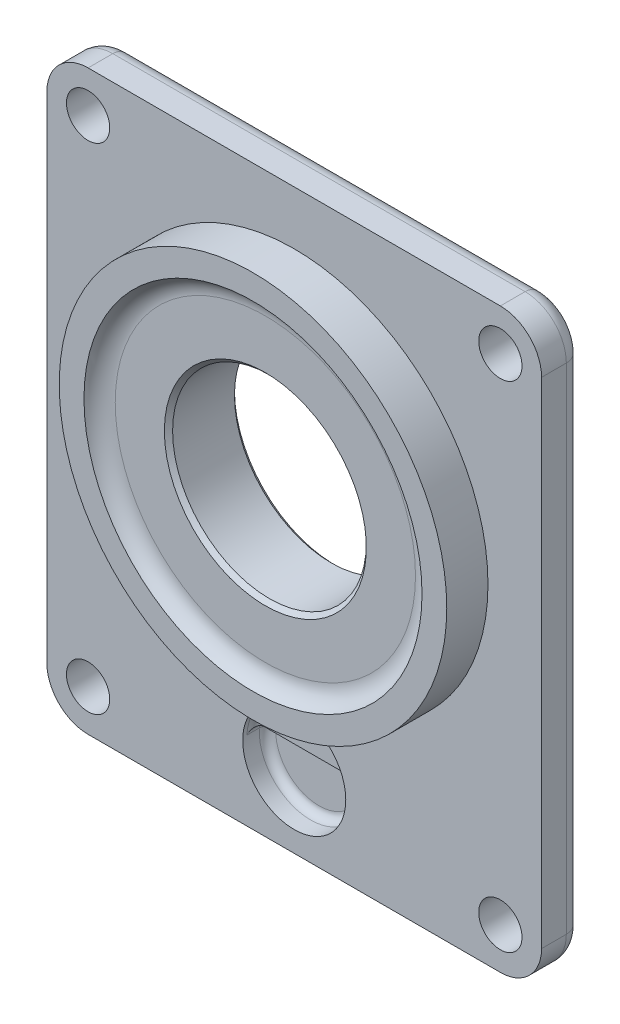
ISO-10303-21;
HEADER;
FILE_DESCRIPTION(('STEP AP214'),'2;1');
FILE_NAME('part.step','',(''),(''),'','','');
FILE_SCHEMA(('AUTOMOTIVE_DESIGN { 1 0 10303 214 1 1 1 1 }'));
ENDSEC;
DATA;
#1=APPLICATION_CONTEXT('core data for automotive mechanical design processes');
#2=APPLICATION_PROTOCOL_DEFINITION('international standard','automotive_design',2000,#1);
#3=PRODUCT_CONTEXT('',#1,'mechanical');
#4=PRODUCT('Part','Part','',(#3));
#5=PRODUCT_RELATED_PRODUCT_CATEGORY('part','',(#4));
#6=PRODUCT_DEFINITION_FORMATION('','',#4);
#7=PRODUCT_DEFINITION_CONTEXT('part definition',#1,'design');
#8=PRODUCT_DEFINITION('design','',#6,#7);
#9=PRODUCT_DEFINITION_SHAPE('','',#8);
#10=(LENGTH_UNIT() NAMED_UNIT(*) SI_UNIT(.MILLI.,.METRE.));
#11=(NAMED_UNIT(*) PLANE_ANGLE_UNIT() SI_UNIT($,.RADIAN.));
#12=(NAMED_UNIT(*) SI_UNIT($,.STERADIAN.) SOLID_ANGLE_UNIT());
#13=UNCERTAINTY_MEASURE_WITH_UNIT(LENGTH_MEASURE(1.E-05),#10,'distance_accuracy_value','');
#14=(GEOMETRIC_REPRESENTATION_CONTEXT(3) GLOBAL_UNCERTAINTY_ASSIGNED_CONTEXT((#13)) GLOBAL_UNIT_ASSIGNED_CONTEXT((#10,
#11,#12)) REPRESENTATION_CONTEXT('',''));
#15=CARTESIAN_POINT('',(0.,0.,0.));
#16=DIRECTION('',(0.,0.,1.));
#17=DIRECTION('',(1.,0.,0.));
#18=AXIS2_PLACEMENT_3D('',#15,#16,#17);
#19=CARTESIAN_POINT('',(60.,17.5,4.));
#20=DIRECTION('',(0.,0.,1.));
#21=DIRECTION('',(1.,0.,0.));
#22=AXIS2_PLACEMENT_3D('',#19,#20,#21);
#23=CYLINDRICAL_SURFACE('',#22,12.5);
#24=DIRECTION('',(0.,0.,1.));
#25=VECTOR('',#24,1.);
#26=CARTESIAN_POINT('',(72.4858196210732,18.0952380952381,4.));
#27=LINE('',#26,#25);
#28=CARTESIAN_POINT('',(72.4858196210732,18.0952380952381,9.));
#29=VERTEX_POINT('',#28);
#30=CARTESIAN_POINT('',(72.4858196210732,18.0952380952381,6.));
#31=VERTEX_POINT('',#30);
#32=EDGE_CURVE('E526',#29,#31,#27,.F.);
#33=ORIENTED_EDGE('',*,*,#32,.T.);
#34=CARTESIAN_POINT('',(60.,17.5,6.));
#35=DIRECTION('',(0.,0.,1.));
#36=DIRECTION('',(1.,0.,0.));
#37=AXIS2_PLACEMENT_3D('',#34,#35,#36);
#38=CIRCLE('',#37,12.5);
#39=CARTESIAN_POINT('',(47.5141803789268,18.0952380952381,6.));
#40=VERTEX_POINT('',#39);
#41=EDGE_CURVE('E524',#31,#40,#38,.F.);
#42=ORIENTED_EDGE('',*,*,#41,.T.);
#43=DIRECTION('',(0.,0.,1.));
#44=VECTOR('',#43,1.);
#45=CARTESIAN_POINT('',(47.5141803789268,18.0952380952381,4.));
#46=LINE('',#45,#44);
#47=CARTESIAN_POINT('',(47.5141803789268,18.0952380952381,9.));
#48=VERTEX_POINT('',#47);
#49=EDGE_CURVE('E547',#40,#48,#46,.T.);
#50=ORIENTED_EDGE('',*,*,#49,.T.);
#51=CARTESIAN_POINT('',(60.,17.5,9.));
#52=DIRECTION('',(0.,0.,-1.));
#53=DIRECTION('',(-1.,0.,0.));
#54=AXIS2_PLACEMENT_3D('',#51,#52,#53);
#55=CIRCLE('',#54,12.5);
#56=EDGE_CURVE('E534',#48,#29,#55,.T.);
#57=ORIENTED_EDGE('',*,*,#56,.T.);
#58=EDGE_LOOP('',(#33,#42,#50,#57));
#59=FACE_BOUND('',#58,.T.);
#60=CARTESIAN_POINT('',(60.,17.5,10.));
#61=DIRECTION('',(0.,0.,1.));
#62=DIRECTION('',(1.,0.,0.));
#63=AXIS2_PLACEMENT_3D('',#60,#61,#62);
#64=CIRCLE('',#63,12.5);
#65=CARTESIAN_POINT('',(72.5,17.5,10.));
#66=VERTEX_POINT('',#65);
#67=EDGE_CURVE('E555',#66,#66,#64,.T.);
#68=ORIENTED_EDGE('',*,*,#67,.T.);
#69=EDGE_LOOP('',(#68));
#70=FACE_BOUND('',#69,.T.);
#71=ADVANCED_FACE('F26',(#59,#70),#23,.F.);
#72=CARTESIAN_POINT('',(60.,17.5,4.));
#73=DIRECTION('',(0.,0.,1.));
#74=DIRECTION('',(1.,0.,0.));
#75=AXIS2_PLACEMENT_3D('',#72,#73,#74);
#76=PLANE('',#75);
#77=CARTESIAN_POINT('',(60.,17.5,4.));
#78=DIRECTION('',(0.,0.,1.));
#79=DIRECTION('',(1.,0.,0.));
#80=AXIS2_PLACEMENT_3D('',#77,#78,#79);
#81=CIRCLE('',#80,10.5);
#82=CARTESIAN_POINT('',(49.5119115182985,18.,4.));
#83=VERTEX_POINT('',#82);
#84=CARTESIAN_POINT('',(70.4880884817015,18.,4.));
#85=VERTEX_POINT('',#84);
#86=EDGE_CURVE('E521',#83,#85,#81,.T.);
#87=ORIENTED_EDGE('',*,*,#86,.T.);
#88=DIRECTION('',(-1.,0.,0.));
#89=VECTOR('',#88,1.);
#90=CARTESIAN_POINT('',(60.,18.,4.));
#91=LINE('',#90,#89);
#92=EDGE_CURVE('E542',#85,#83,#91,.T.);
#93=ORIENTED_EDGE('',*,*,#92,.T.);
#94=EDGE_LOOP('',(#87,#93));
#95=FACE_BOUND('',#94,.T.);
#96=ADVANCED_FACE('F309',(#95),#76,.T.);
#97=CARTESIAN_POINT('',(0.,0.,17.));
#98=DIRECTION('',(1.,0.,0.));
#99=DIRECTION('',(0.,0.,-1.));
#100=AXIS2_PLACEMENT_3D('',#97,#98,#99);
#101=PLANE('',#100);
#102=DIRECTION('',(0.,0.,-1.));
#103=VECTOR('',#102,1.);
#104=CARTESIAN_POINT('',(0.,130.,17.));
#105=LINE('',#104,#103);
#106=CARTESIAN_POINT('',(0.,130.,10.));
#107=VERTEX_POINT('',#106);
#108=CARTESIAN_POINT('',(0.,130.,4.));
#109=VERTEX_POINT('',#108);
#110=EDGE_CURVE('E381',#107,#109,#105,.T.);
#111=ORIENTED_EDGE('',*,*,#110,.T.);
#112=DIRECTION('',(0.,-1.,0.));
#113=VECTOR('',#112,1.);
#114=CARTESIAN_POINT('',(0.,10.,4.));
#115=LINE('',#114,#113);
#116=CARTESIAN_POINT('',(0.,10.,4.));
#117=VERTEX_POINT('',#116);
#118=EDGE_CURVE('E403',#109,#117,#115,.T.);
#119=ORIENTED_EDGE('',*,*,#118,.T.);
#120=DIRECTION('',(0.,0.,-1.));
#121=VECTOR('',#120,1.);
#122=CARTESIAN_POINT('',(0.,10.,17.));
#123=LINE('',#122,#121);
#124=CARTESIAN_POINT('',(0.,10.,10.));
#125=VERTEX_POINT('',#124);
#126=EDGE_CURVE('E386',#117,#125,#123,.F.);
#127=ORIENTED_EDGE('',*,*,#126,.T.);
#128=DIRECTION('',(0.,-1.,0.));
#129=VECTOR('',#128,1.);
#130=CARTESIAN_POINT('',(0.,0.,10.));
#131=LINE('',#130,#129);
#132=EDGE_CURVE('E568',#107,#125,#131,.T.);
#133=ORIENTED_EDGE('',*,*,#132,.F.);
#134=EDGE_LOOP('',(#111,#119,#127,#133));
#135=FACE_BOUND('',#134,.T.);
#136=ADVANCED_FACE('F28',(#135),#101,.F.);
#137=CARTESIAN_POINT('',(0.,0.,17.));
#138=DIRECTION('',(0.,1.,0.));
#139=DIRECTION('',(0.,0.,1.));
#140=AXIS2_PLACEMENT_3D('',#137,#138,#139);
#141=PLANE('',#140);
#142=DIRECTION('',(0.,0.,-1.));
#143=VECTOR('',#142,1.);
#144=CARTESIAN_POINT('',(10.,0.,17.));
#145=LINE('',#144,#143);
#146=CARTESIAN_POINT('',(10.,0.,10.));
#147=VERTEX_POINT('',#146);
#148=CARTESIAN_POINT('',(10.,0.,4.));
#149=VERTEX_POINT('',#148);
#150=EDGE_CURVE('E371',#147,#149,#145,.T.);
#151=ORIENTED_EDGE('',*,*,#150,.T.);
#152=DIRECTION('',(1.,0.,0.));
#153=VECTOR('',#152,1.);
#154=CARTESIAN_POINT('',(110.,0.,4.));
#155=LINE('',#154,#153);
#156=CARTESIAN_POINT('',(110.,0.,4.));
#157=VERTEX_POINT('',#156);
#158=EDGE_CURVE('E373',#149,#157,#155,.T.);
#159=ORIENTED_EDGE('',*,*,#158,.T.);
#160=DIRECTION('',(0.,0.,-1.));
#161=VECTOR('',#160,1.);
#162=CARTESIAN_POINT('',(110.,0.,17.));
#163=LINE('',#162,#161);
#164=CARTESIAN_POINT('',(110.,0.,10.));
#165=VERTEX_POINT('',#164);
#166=EDGE_CURVE('E380',#157,#165,#163,.F.);
#167=ORIENTED_EDGE('',*,*,#166,.T.);
#168=DIRECTION('',(1.,0.,0.));
#169=VECTOR('',#168,1.);
#170=CARTESIAN_POINT('',(0.,0.,10.));
#171=LINE('',#170,#169);
#172=EDGE_CURVE('E376',#147,#165,#171,.T.);
#173=ORIENTED_EDGE('',*,*,#172,.F.);
#174=EDGE_LOOP('',(#151,#159,#167,#173));
#175=FACE_BOUND('',#174,.T.);
#176=ADVANCED_FACE('F359',(#175),#141,.F.);
#177=CARTESIAN_POINT('',(120.,0.,17.));
#178=DIRECTION('',(-1.,0.,0.));
#179=DIRECTION('',(0.,0.,1.));
#180=AXIS2_PLACEMENT_3D('',#177,#178,#179);
#181=PLANE('',#180);
#182=DIRECTION('',(0.,0.,-1.));
#183=VECTOR('',#182,1.);
#184=CARTESIAN_POINT('',(120.,10.,17.));
#185=LINE('',#184,#183);
#186=CARTESIAN_POINT('',(120.,10.,10.));
#187=VERTEX_POINT('',#186);
#188=CARTESIAN_POINT('',(120.,10.,4.));
#189=VERTEX_POINT('',#188);
#190=EDGE_CURVE('E601',#187,#189,#185,.T.);
#191=ORIENTED_EDGE('',*,*,#190,.T.);
#192=DIRECTION('',(0.,1.,0.));
#193=VECTOR('',#192,1.);
#194=CARTESIAN_POINT('',(120.,130.,4.));
#195=LINE('',#194,#193);
#196=CARTESIAN_POINT('',(120.,130.,4.));
#197=VERTEX_POINT('',#196);
#198=EDGE_CURVE('E415',#189,#197,#195,.T.);
#199=ORIENTED_EDGE('',*,*,#198,.T.);
#200=DIRECTION('',(0.,0.,-1.));
#201=VECTOR('',#200,1.);
#202=CARTESIAN_POINT('',(120.,130.,17.));
#203=LINE('',#202,#201);
#204=CARTESIAN_POINT('',(120.,130.,10.));
#205=VERTEX_POINT('',#204);
#206=EDGE_CURVE('E606',#197,#205,#203,.F.);
#207=ORIENTED_EDGE('',*,*,#206,.T.);
#208=DIRECTION('',(0.,1.,0.));
#209=VECTOR('',#208,1.);
#210=CARTESIAN_POINT('',(120.,0.,10.));
#211=LINE('',#210,#209);
#212=EDGE_CURVE('E564',#187,#205,#211,.T.);
#213=ORIENTED_EDGE('',*,*,#212,.F.);
#214=EDGE_LOOP('',(#191,#199,#207,#213));
#215=FACE_BOUND('',#214,.T.);
#216=ADVANCED_FACE('F356',(#215),#181,.F.);
#217=CARTESIAN_POINT('',(0.,140.,17.));
#218=DIRECTION('',(0.,-1.,0.));
#219=DIRECTION('',(0.,0.,-1.));
#220=AXIS2_PLACEMENT_3D('',#217,#218,#219);
#221=PLANE('',#220);
#222=DIRECTION('',(0.,0.,-1.));
#223=VECTOR('',#222,1.);
#224=CARTESIAN_POINT('',(110.,140.,17.));
#225=LINE('',#224,#223);
#226=CARTESIAN_POINT('',(110.,140.,10.));
#227=VERTEX_POINT('',#226);
#228=CARTESIAN_POINT('',(110.,140.,4.));
#229=VERTEX_POINT('',#228);
#230=EDGE_CURVE('E597',#227,#229,#225,.T.);
#231=ORIENTED_EDGE('',*,*,#230,.T.);
#232=DIRECTION('',(-1.,0.,0.));
#233=VECTOR('',#232,1.);
#234=CARTESIAN_POINT('',(10.,140.,4.));
#235=LINE('',#234,#233);
#236=CARTESIAN_POINT('',(10.,140.,4.));
#237=VERTEX_POINT('',#236);
#238=EDGE_CURVE('E413',#229,#237,#235,.T.);
#239=ORIENTED_EDGE('',*,*,#238,.T.);
#240=DIRECTION('',(0.,0.,-1.));
#241=VECTOR('',#240,1.);
#242=CARTESIAN_POINT('',(10.,140.,17.));
#243=LINE('',#242,#241);
#244=CARTESIAN_POINT('',(10.,140.,10.));
#245=VERTEX_POINT('',#244);
#246=EDGE_CURVE('E596',#237,#245,#243,.F.);
#247=ORIENTED_EDGE('',*,*,#246,.T.);
#248=DIRECTION('',(-1.,0.,0.));
#249=VECTOR('',#248,1.);
#250=CARTESIAN_POINT('',(0.,140.,10.));
#251=LINE('',#250,#249);
#252=EDGE_CURVE('E592',#227,#245,#251,.T.);
#253=ORIENTED_EDGE('',*,*,#252,.F.);
#254=EDGE_LOOP('',(#231,#239,#247,#253));
#255=FACE_BOUND('',#254,.T.);
#256=ADVANCED_FACE('F349',(#255),#221,.F.);
#257=CARTESIAN_POINT('',(0.,140.,0.));
#258=DIRECTION('',(0.,0.,-1.));
#259=DIRECTION('',(-1.,0.,0.));
#260=AXIS2_PLACEMENT_3D('',#257,#258,#259);
#261=PLANE('',#260);
#262=CARTESIAN_POINT('',(60.,117.,0.));
#263=DIRECTION('',(0.,0.,-1.));
#264=DIRECTION('',(-1.,0.,0.));
#265=AXIS2_PLACEMENT_3D('',#262,#263,#264);
#266=CIRCLE('',#265,2.3);
#267=CARTESIAN_POINT('',(57.7,117.,0.));
#268=VERTEX_POINT('',#267);
#269=EDGE_CURVE('E666',#268,#268,#266,.F.);
#270=ORIENTED_EDGE('',*,*,#269,.T.);
#271=EDGE_LOOP('',(#270));
#272=FACE_BOUND('',#271,.T.);
#273=CARTESIAN_POINT('',(24.8109088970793,91.433628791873,0.));
#274=DIRECTION('',(0.,0.,-1.));
#275=DIRECTION('',(-1.,0.,0.));
#276=AXIS2_PLACEMENT_3D('',#273,#274,#275);
#277=CIRCLE('',#276,2.3);
#278=CARTESIAN_POINT('',(22.5109088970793,91.433628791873,0.));
#279=VERTEX_POINT('',#278);
#280=EDGE_CURVE('E663',#279,#279,#277,.F.);
#281=ORIENTED_EDGE('',*,*,#280,.T.);
#282=EDGE_LOOP('',(#281));
#283=FACE_BOUND('',#282,.T.);
#284=CARTESIAN_POINT('',(38.2519456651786,50.0663712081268,0.));
#285=DIRECTION('',(0.,0.,-1.));
#286=DIRECTION('',(-1.,0.,0.));
#287=AXIS2_PLACEMENT_3D('',#284,#285,#286);
#288=CIRCLE('',#287,2.3);
#289=CARTESIAN_POINT('',(35.9519456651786,50.0663712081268,0.));
#290=VERTEX_POINT('',#289);
#291=EDGE_CURVE('E660',#290,#290,#288,.F.);
#292=ORIENTED_EDGE('',*,*,#291,.T.);
#293=EDGE_LOOP('',(#292));
#294=FACE_BOUND('',#293,.T.);
#295=CARTESIAN_POINT('',(81.7480543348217,50.0663712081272,0.));
#296=DIRECTION('',(0.,0.,-1.));
#297=DIRECTION('',(-1.,0.,0.));
#298=AXIS2_PLACEMENT_3D('',#295,#296,#297);
#299=CIRCLE('',#298,2.3);
#300=CARTESIAN_POINT('',(79.4480543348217,50.0663712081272,0.));
#301=VERTEX_POINT('',#300);
#302=EDGE_CURVE('E657',#301,#301,#299,.F.);
#303=ORIENTED_EDGE('',*,*,#302,.T.);
#304=EDGE_LOOP('',(#303));
#305=FACE_BOUND('',#304,.T.);
#306=CARTESIAN_POINT('',(95.1890911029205,91.4336287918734,0.));
#307=DIRECTION('',(0.,0.,-1.));
#308=DIRECTION('',(-1.,0.,0.));
#309=AXIS2_PLACEMENT_3D('',#306,#307,#308);
#310=CIRCLE('',#309,2.3);
#311=CARTESIAN_POINT('',(92.8890911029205,91.4336287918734,0.));
#312=VERTEX_POINT('',#311);
#313=EDGE_CURVE('E654',#312,#312,#310,.F.);
#314=ORIENTED_EDGE('',*,*,#313,.T.);
#315=EDGE_LOOP('',(#314));
#316=FACE_BOUND('',#315,.T.);
#317=DIRECTION('',(0.,-1.,0.));
#318=VECTOR('',#317,1.);
#319=CARTESIAN_POINT('',(4.,130.,0.));
#320=LINE('',#319,#318);
#321=CARTESIAN_POINT('',(4.,11.7500000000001,0.));
#322=VERTEX_POINT('',#321);
#323=CARTESIAN_POINT('',(4.,128.25,0.));
#324=VERTEX_POINT('',#323);
#325=EDGE_CURVE('E398',#322,#324,#320,.F.);
#326=ORIENTED_EDGE('',*,*,#325,.T.);
#327=CARTESIAN_POINT('',(10.,130.,0.));
#328=DIRECTION('',(0.,0.,-1.));
#329=DIRECTION('',(-1.,0.,0.));
#330=AXIS2_PLACEMENT_3D('',#327,#328,#329);
#331=CIRCLE('',#330,6.25000000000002);
#332=CARTESIAN_POINT('',(11.75,136.,0.));
#333=VERTEX_POINT('',#332);
#334=EDGE_CURVE('E427',#324,#333,#331,.F.);
#335=ORIENTED_EDGE('',*,*,#334,.T.);
#336=DIRECTION('',(-1.,0.,0.));
#337=VECTOR('',#336,1.);
#338=CARTESIAN_POINT('',(110.,136.,0.));
#339=LINE('',#338,#337);
#340=CARTESIAN_POINT('',(108.25,136.,0.));
#341=VERTEX_POINT('',#340);
#342=EDGE_CURVE('E395',#333,#341,#339,.F.);
#343=ORIENTED_EDGE('',*,*,#342,.T.);
#344=CARTESIAN_POINT('',(110.,130.,0.));
#345=DIRECTION('',(0.,0.,-1.));
#346=DIRECTION('',(-1.,0.,0.));
#347=AXIS2_PLACEMENT_3D('',#344,#345,#346);
#348=CIRCLE('',#347,6.25000000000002);
#349=CARTESIAN_POINT('',(116.,128.25,0.));
#350=VERTEX_POINT('',#349);
#351=EDGE_CURVE('E424',#341,#350,#348,.F.);
#352=ORIENTED_EDGE('',*,*,#351,.T.);
#353=DIRECTION('',(0.,1.,0.));
#354=VECTOR('',#353,1.);
#355=CARTESIAN_POINT('',(116.,10.,0.));
#356=LINE('',#355,#354);
#357=CARTESIAN_POINT('',(116.,11.7500000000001,0.));
#358=VERTEX_POINT('',#357);
#359=EDGE_CURVE('E383',#350,#358,#356,.F.);
#360=ORIENTED_EDGE('',*,*,#359,.T.);
#361=CARTESIAN_POINT('',(110.,10.,0.));
#362=DIRECTION('',(0.,0.,-1.));
#363=DIRECTION('',(-1.,0.,0.));
#364=AXIS2_PLACEMENT_3D('',#361,#362,#363);
#365=CIRCLE('',#364,6.25000000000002);
#366=CARTESIAN_POINT('',(108.25,4.,0.));
#367=VERTEX_POINT('',#366);
#368=EDGE_CURVE('E421',#358,#367,#365,.F.);
#369=ORIENTED_EDGE('',*,*,#368,.T.);
#370=DIRECTION('',(1.,0.,0.));
#371=VECTOR('',#370,1.);
#372=CARTESIAN_POINT('',(10.,4.,0.));
#373=LINE('',#372,#371);
#374=CARTESIAN_POINT('',(11.7500000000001,4.,0.));
#375=VERTEX_POINT('',#374);
#376=EDGE_CURVE('E392',#367,#375,#373,.F.);
#377=ORIENTED_EDGE('',*,*,#376,.T.);
#378=CARTESIAN_POINT('',(10.,10.,0.));
#379=DIRECTION('',(0.,0.,-1.));
#380=DIRECTION('',(-1.,0.,0.));
#381=AXIS2_PLACEMENT_3D('',#378,#379,#380);
#382=CIRCLE('',#381,6.25000000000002);
#383=EDGE_CURVE('E418',#375,#322,#382,.F.);
#384=ORIENTED_EDGE('',*,*,#383,.T.);
#385=EDGE_LOOP('',(#326,#335,#343,#352,#360,#369,#377,#384));
#386=FACE_BOUND('',#385,.T.);
#387=CARTESIAN_POINT('',(60.,80.,0.));
#388=DIRECTION('',(0.,0.,-1.));
#389=DIRECTION('',(-1.,0.,0.));
#390=AXIS2_PLACEMENT_3D('',#387,#388,#389);
#391=CIRCLE('',#390,24.5);
#392=CARTESIAN_POINT('',(35.5,80.,0.));
#393=VERTEX_POINT('',#392);
#394=EDGE_CURVE('E589',#393,#393,#391,.F.);
#395=ORIENTED_EDGE('',*,*,#394,.T.);
#396=EDGE_LOOP('',(#395));
#397=FACE_BOUND('',#396,.T.);
#398=ADVANCED_FACE('F342',(#272,#283,#294,#305,#316,#386,#397),#261,.T.);
#399=CARTESIAN_POINT('',(60.,80.,20.));
#400=DIRECTION('',(0.,0.,1.));
#401=DIRECTION('',(1.,0.,0.));
#402=AXIS2_PLACEMENT_3D('',#399,#400,#401);
#403=PLANE('',#402);
#404=CARTESIAN_POINT('',(60.,80.,20.));
#405=DIRECTION('',(0.,0.,1.));
#406=DIRECTION('',(1.,0.,0.));
#407=AXIS2_PLACEMENT_3D('',#404,#405,#406);
#408=CIRCLE('',#407,47.);
#409=CARTESIAN_POINT('',(107.,80.,20.));
#410=VERTEX_POINT('',#409);
#411=EDGE_CURVE('E574',#410,#410,#408,.T.);
#412=ORIENTED_EDGE('',*,*,#411,.T.);
#413=EDGE_LOOP('',(#412));
#414=FACE_BOUND('',#413,.T.);
#415=CARTESIAN_POINT('',(60.,80.,20.));
#416=DIRECTION('',(0.,0.,1.));
#417=DIRECTION('',(1.,0.,0.));
#418=AXIS2_PLACEMENT_3D('',#415,#416,#417);
#419=CIRCLE('',#418,41.);
#420=CARTESIAN_POINT('',(101.,80.,20.));
#421=VERTEX_POINT('',#420);
#422=EDGE_CURVE('E571',#421,#421,#419,.T.);
#423=ORIENTED_EDGE('',*,*,#422,.F.);
#424=EDGE_LOOP('',(#423));
#425=FACE_BOUND('',#424,.T.);
#426=ADVANCED_FACE('F338',(#414,#425),#403,.T.);
#427=CARTESIAN_POINT('',(60.,80.,20.));
#428=DIRECTION('',(0.,0.,-1.));
#429=DIRECTION('',(-1.,0.,0.));
#430=AXIS2_PLACEMENT_3D('',#427,#428,#429);
#431=CYLINDRICAL_SURFACE('',#430,47.);
#432=ORIENTED_EDGE('',*,*,#411,.F.);
#433=EDGE_LOOP('',(#432));
#434=FACE_BOUND('',#433,.T.);
#435=CARTESIAN_POINT('',(60.,80.,10.));
#436=DIRECTION('',(0.,0.,1.));
#437=DIRECTION('',(1.,0.,0.));
#438=AXIS2_PLACEMENT_3D('',#435,#436,#437);
#439=CIRCLE('',#438,47.);
#440=CARTESIAN_POINT('',(107.,80.,10.));
#441=VERTEX_POINT('',#440);
#442=EDGE_CURVE('E559',#441,#441,#439,.T.);
#443=ORIENTED_EDGE('',*,*,#442,.T.);
#444=EDGE_LOOP('',(#443));
#445=FACE_BOUND('',#444,.T.);
#446=ADVANCED_FACE('F341',(#434,#445),#431,.T.);
#447=CARTESIAN_POINT('',(0.,140.,17.));
#448=DIRECTION('',(0.,0.,-1.));
#449=DIRECTION('',(-1.,0.,0.));
#450=AXIS2_PLACEMENT_3D('',#447,#448,#449);
#451=PLANE('',#450);
#452=CARTESIAN_POINT('',(60.,80.,17.));
#453=DIRECTION('',(0.,0.,-1.));
#454=DIRECTION('',(-1.,0.,0.));
#455=AXIS2_PLACEMENT_3D('',#452,#453,#454);
#456=CIRCLE('',#455,24.5);
#457=CARTESIAN_POINT('',(35.5,80.,17.));
#458=VERTEX_POINT('',#457);
#459=EDGE_CURVE('E580',#458,#458,#456,.T.);
#460=ORIENTED_EDGE('',*,*,#459,.T.);
#461=EDGE_LOOP('',(#460));
#462=FACE_BOUND('',#461,.T.);
#463=CARTESIAN_POINT('',(60.,80.,17.));
#464=DIRECTION('',(0.,0.,-1.));
#465=DIRECTION('',(-1.,0.,0.));
#466=AXIS2_PLACEMENT_3D('',#463,#464,#465);
#467=CIRCLE('',#466,36.4174243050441);
#468=CARTESIAN_POINT('',(23.5825756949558,80.,17.));
#469=VERTEX_POINT('',#468);
#470=EDGE_CURVE('E577',#469,#469,#467,.F.);
#471=ORIENTED_EDGE('',*,*,#470,.T.);
#472=EDGE_LOOP('',(#471));
#473=FACE_BOUND('',#472,.T.);
#474=ADVANCED_FACE('F336',(#462,#473),#451,.F.);
#475=CARTESIAN_POINT('',(60.,80.,0.));
#476=DIRECTION('',(0.,0.,1.));
#477=DIRECTION('',(1.,0.,0.));
#478=AXIS2_PLACEMENT_3D('',#475,#476,#477);
#479=CYLINDRICAL_SURFACE('',#478,23.5);
#480=CARTESIAN_POINT('',(60.,80.,16.));
#481=DIRECTION('',(0.,0.,-1.));
#482=DIRECTION('',(-1.,0.,0.));
#483=AXIS2_PLACEMENT_3D('',#480,#481,#482);
#484=CIRCLE('',#483,23.5);
#485=CARTESIAN_POINT('',(36.5,80.,16.));
#486=VERTEX_POINT('',#485);
#487=EDGE_CURVE('E586',#486,#486,#484,.F.);
#488=ORIENTED_EDGE('',*,*,#487,.T.);
#489=EDGE_LOOP('',(#488));
#490=FACE_BOUND('',#489,.T.);
#491=CARTESIAN_POINT('',(60.,80.,1.00000000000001));
#492=DIRECTION('',(0.,0.,-1.));
#493=DIRECTION('',(-1.,0.,0.));
#494=AXIS2_PLACEMENT_3D('',#491,#492,#493);
#495=CIRCLE('',#494,23.5);
#496=CARTESIAN_POINT('',(36.5,80.,1.00000000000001));
#497=VERTEX_POINT('',#496);
#498=EDGE_CURVE('E583',#497,#497,#495,.T.);
#499=ORIENTED_EDGE('',*,*,#498,.T.);
#500=EDGE_LOOP('',(#499));
#501=FACE_BOUND('',#500,.T.);
#502=ADVANCED_FACE('F332',(#490,#501),#479,.F.);
#503=CARTESIAN_POINT('',(60.,80.,22.));
#504=DIRECTION('',(0.,0.,1.));
#505=DIRECTION('',(1.,0.,0.));
#506=AXIS2_PLACEMENT_3D('',#503,#504,#505);
#507=TOROIDAL_SURFACE('',#506,36.4174243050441,5.);
#508=ORIENTED_EDGE('',*,*,#422,.T.);
#509=EDGE_LOOP('',(#508));
#510=FACE_BOUND('',#509,.T.);
#511=ORIENTED_EDGE('',*,*,#470,.F.);
#512=EDGE_LOOP('',(#511));
#513=FACE_BOUND('',#512,.T.);
#514=ADVANCED_FACE('F328',(#510,#513),#507,.F.);
#515=CARTESIAN_POINT('',(60.,80.,17.));
#516=DIRECTION('',(0.,0.,1.));
#517=DIRECTION('',(1.,0.,0.));
#518=AXIS2_PLACEMENT_3D('',#515,#516,#517);
#519=CONICAL_SURFACE('',#518,24.5,0.785398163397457);
#520=ORIENTED_EDGE('',*,*,#487,.F.);
#521=EDGE_LOOP('',(#520));
#522=FACE_BOUND('',#521,.T.);
#523=ORIENTED_EDGE('',*,*,#459,.F.);
#524=EDGE_LOOP('',(#523));
#525=FACE_BOUND('',#524,.T.);
#526=ADVANCED_FACE('F324',(#522,#525),#519,.F.);
#527=CARTESIAN_POINT('',(60.,80.,0.));
#528=DIRECTION('',(0.,0.,-1.));
#529=DIRECTION('',(-1.,0.,0.));
#530=AXIS2_PLACEMENT_3D('',#527,#528,#529);
#531=CONICAL_SURFACE('',#530,24.5,0.785398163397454);
#532=ORIENTED_EDGE('',*,*,#498,.F.);
#533=EDGE_LOOP('',(#532));
#534=FACE_BOUND('',#533,.T.);
#535=ORIENTED_EDGE('',*,*,#394,.F.);
#536=EDGE_LOOP('',(#535));
#537=FACE_BOUND('',#536,.T.);
#538=ADVANCED_FACE('F320',(#534,#537),#531,.F.);
#539=CARTESIAN_POINT('',(60.,80.,10.));
#540=DIRECTION('',(0.,0.,1.));
#541=DIRECTION('',(1.,0.,0.));
#542=AXIS2_PLACEMENT_3D('',#539,#540,#541);
#543=PLANE('',#542);
#544=CARTESIAN_POINT('',(10.,10.,10.));
#545=DIRECTION('',(0.,0.,1.));
#546=DIRECTION('',(1.,0.,0.));
#547=AXIS2_PLACEMENT_3D('',#544,#545,#546);
#548=CIRCLE('',#547,5.25);
#549=CARTESIAN_POINT('',(15.25,10.,10.));
#550=VERTEX_POINT('',#549);
#551=EDGE_CURVE('E213',#550,#550,#548,.T.);
#552=ORIENTED_EDGE('',*,*,#551,.F.);
#553=EDGE_LOOP('',(#552));
#554=FACE_BOUND('',#553,.T.);
#555=CARTESIAN_POINT('',(110.,10.,10.));
#556=DIRECTION('',(0.,0.,1.));
#557=DIRECTION('',(1.,0.,0.));
#558=AXIS2_PLACEMENT_3D('',#555,#556,#557);
#559=CIRCLE('',#558,5.25);
#560=CARTESIAN_POINT('',(115.25,10.,10.));
#561=VERTEX_POINT('',#560);
#562=EDGE_CURVE('E216',#561,#561,#559,.T.);
#563=ORIENTED_EDGE('',*,*,#562,.F.);
#564=EDGE_LOOP('',(#563));
#565=FACE_BOUND('',#564,.T.);
#566=CARTESIAN_POINT('',(110.,130.,10.));
#567=DIRECTION('',(0.,0.,1.));
#568=DIRECTION('',(1.,0.,0.));
#569=AXIS2_PLACEMENT_3D('',#566,#567,#568);
#570=CIRCLE('',#569,5.25);
#571=CARTESIAN_POINT('',(115.25,130.,10.));
#572=VERTEX_POINT('',#571);
#573=EDGE_CURVE('E219',#572,#572,#570,.T.);
#574=ORIENTED_EDGE('',*,*,#573,.F.);
#575=EDGE_LOOP('',(#574));
#576=FACE_BOUND('',#575,.T.);
#577=CARTESIAN_POINT('',(10.,130.,10.));
#578=DIRECTION('',(0.,0.,1.));
#579=DIRECTION('',(1.,0.,0.));
#580=AXIS2_PLACEMENT_3D('',#577,#578,#579);
#581=CIRCLE('',#580,5.25);
#582=CARTESIAN_POINT('',(15.25,130.,10.));
#583=VERTEX_POINT('',#582);
#584=EDGE_CURVE('E222',#583,#583,#581,.T.);
#585=ORIENTED_EDGE('',*,*,#584,.F.);
#586=EDGE_LOOP('',(#585));
#587=FACE_BOUND('',#586,.T.);
#588=ORIENTED_EDGE('',*,*,#67,.F.);
#589=EDGE_LOOP('',(#588));
#590=FACE_BOUND('',#589,.T.);
#591=ORIENTED_EDGE('',*,*,#442,.F.);
#592=EDGE_LOOP('',(#591));
#593=FACE_BOUND('',#592,.T.);
#594=ORIENTED_EDGE('',*,*,#212,.T.);
#595=CARTESIAN_POINT('',(110.,130.,10.));
#596=DIRECTION('',(0.,0.,1.));
#597=DIRECTION('',(1.,0.,0.));
#598=AXIS2_PLACEMENT_3D('',#595,#596,#597);
#599=CIRCLE('',#598,10.);
#600=EDGE_CURVE('E614',#205,#227,#599,.T.);
#601=ORIENTED_EDGE('',*,*,#600,.T.);
#602=ORIENTED_EDGE('',*,*,#252,.T.);
#603=CARTESIAN_POINT('',(10.,130.,10.));
#604=DIRECTION('',(0.,0.,1.));
#605=DIRECTION('',(1.,0.,0.));
#606=AXIS2_PLACEMENT_3D('',#603,#604,#605);
#607=CIRCLE('',#606,10.);
#608=EDGE_CURVE('E612',#245,#107,#607,.T.);
#609=ORIENTED_EDGE('',*,*,#608,.T.);
#610=ORIENTED_EDGE('',*,*,#132,.T.);
#611=CARTESIAN_POINT('',(10.,10.,10.));
#612=DIRECTION('',(0.,0.,1.));
#613=DIRECTION('',(1.,0.,0.));
#614=AXIS2_PLACEMENT_3D('',#611,#612,#613);
#615=CIRCLE('',#614,10.);
#616=EDGE_CURVE('E608',#125,#147,#615,.T.);
#617=ORIENTED_EDGE('',*,*,#616,.T.);
#618=ORIENTED_EDGE('',*,*,#172,.T.);
#619=CARTESIAN_POINT('',(110.,10.,10.));
#620=DIRECTION('',(0.,0.,1.));
#621=DIRECTION('',(1.,0.,0.));
#622=AXIS2_PLACEMENT_3D('',#619,#620,#621);
#623=CIRCLE('',#622,10.);
#624=EDGE_CURVE('E610',#165,#187,#623,.T.);
#625=ORIENTED_EDGE('',*,*,#624,.T.);
#626=EDGE_LOOP('',(#594,#601,#602,#609,#610,#617,#618,#625));
#627=FACE_BOUND('',#626,.T.);
#628=ADVANCED_FACE('F317',(#554,#565,#576,#587,#590,#593,#627),#543,.T.);
#629=CARTESIAN_POINT('',(40.,30.,7.));
#630=DIRECTION('',(0.,0.,-1.));
#631=DIRECTION('',(-1.,0.,0.));
#632=AXIS2_PLACEMENT_3D('',#629,#630,#631);
#633=PLANE('',#632);
#634=DIRECTION('',(1.,0.,0.));
#635=VECTOR('',#634,1.);
#636=CARTESIAN_POINT('',(40.,20.,7.));
#637=LINE('',#636,#635);
#638=CARTESIAN_POINT('',(49.8019609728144,20.,7.));
#639=VERTEX_POINT('',#638);
#640=CARTESIAN_POINT('',(70.1980390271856,20.,7.));
#641=VERTEX_POINT('',#640);
#642=EDGE_CURVE('E553',#639,#641,#637,.T.);
#643=ORIENTED_EDGE('',*,*,#642,.T.);
#644=CARTESIAN_POINT('',(60.,17.5,7.));
#645=DIRECTION('',(0.,0.,-1.));
#646=DIRECTION('',(-1.,0.,0.));
#647=AXIS2_PLACEMENT_3D('',#644,#645,#646);
#648=CIRCLE('',#647,10.5);
#649=EDGE_CURVE('E297',#641,#639,#648,.F.);
#650=ORIENTED_EDGE('',*,*,#649,.T.);
#651=EDGE_LOOP('',(#643,#650));
#652=FACE_BOUND('',#651,.T.);
#653=ADVANCED_FACE('F307',(#652),#633,.F.);
#654=CARTESIAN_POINT('',(40.,20.,7.));
#655=DIRECTION('',(0.,1.,0.));
#656=DIRECTION('',(0.,0.,1.));
#657=AXIS2_PLACEMENT_3D('',#654,#655,#656);
#658=PLANE('',#657);
#659=DIRECTION('',(-1.,0.,0.));
#660=VECTOR('',#659,1.);
#661=CARTESIAN_POINT('',(40.,20.,6.));
#662=LINE('',#661,#660);
#663=CARTESIAN_POINT('',(49.5119115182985,20.,6.));
#664=VERTEX_POINT('',#663);
#665=CARTESIAN_POINT('',(70.4880884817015,20.,6.));
#666=VERTEX_POINT('',#665);
#667=EDGE_CURVE('E535',#664,#666,#662,.F.);
#668=ORIENTED_EDGE('',*,*,#667,.T.);
#669=DIRECTION('',(0.,0.,-1.));
#670=VECTOR('',#669,1.);
#671=CARTESIAN_POINT('',(70.4880884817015,20.,7.));
#672=LINE('',#671,#670);
#673=CARTESIAN_POINT('',(70.4880884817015,20.,7.0199707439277));
#674=VERTEX_POINT('',#673);
#675=EDGE_CURVE('E530',#666,#674,#672,.F.);
#676=ORIENTED_EDGE('',*,*,#675,.T.);
#677=CARTESIAN_POINT('',(70.4880884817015,20.,7.0199707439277));
#678=CARTESIAN_POINT('',(70.4399759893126,20.,7.01331450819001));
#679=CARTESIAN_POINT('',(70.3917489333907,20.,7.00832216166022));
#680=CARTESIAN_POINT('',(70.295065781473,20.,7.0016652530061));
#681=CARTESIAN_POINT('',(70.2466096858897,20.,7.00000068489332));
#682=CARTESIAN_POINT('',(70.1980390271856,20.,6.99999999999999));
#683=B_SPLINE_CURVE_WITH_KNOTS('',3,(#677,#678,#679,#680,#681,#682),.UNSPECIFIED.,.F.,.F.,(4,2,
4),(0.,0.145454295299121,0.290908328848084),.UNSPECIFIED.);
#684=EDGE_CURVE('E296',#674,#641,#683,.T.);
#685=ORIENTED_EDGE('',*,*,#684,.T.);
#686=ORIENTED_EDGE('',*,*,#642,.F.);
#687=CARTESIAN_POINT('',(49.8019609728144,20.,7.));
#688=CARTESIAN_POINT('',(49.7533903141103,20.,7.00000068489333));
#689=CARTESIAN_POINT('',(49.704934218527,20.,7.0016652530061));
#690=CARTESIAN_POINT('',(49.6082510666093,20.,7.00832216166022));
#691=CARTESIAN_POINT('',(49.5600240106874,20.,7.01331450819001));
#692=CARTESIAN_POINT('',(49.5119115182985,20.,7.0199707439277));
#693=B_SPLINE_CURVE_WITH_KNOTS('',3,(#687,#688,#689,#690,#691,#692),.UNSPECIFIED.,.F.,.F.,(4,2,
4),(0.,0.145454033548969,0.290908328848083),.UNSPECIFIED.);
#694=CARTESIAN_POINT('',(49.5119115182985,20.,7.0199707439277));
#695=VERTEX_POINT('',#694);
#696=EDGE_CURVE('E289',#639,#695,#693,.T.);
#697=ORIENTED_EDGE('',*,*,#696,.T.);
#698=DIRECTION('',(0.,0.,-1.));
#699=VECTOR('',#698,1.);
#700=CARTESIAN_POINT('',(49.5119115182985,20.,4.));
#701=LINE('',#700,#699);
#702=EDGE_CURVE('E538',#695,#664,#701,.T.);
#703=ORIENTED_EDGE('',*,*,#702,.T.);
#704=EDGE_LOOP('',(#668,#676,#685,#686,#697,#703));
#705=FACE_BOUND('',#704,.T.);
#706=ADVANCED_FACE('F281',(#705),#658,.F.);
#707=CARTESIAN_POINT('',(60.,17.5,9.));
#708=DIRECTION('',(0.,0.,-1.));
#709=DIRECTION('',(-1.,0.,0.));
#710=AXIS2_PLACEMENT_3D('',#707,#708,#709);
#711=TOROIDAL_SURFACE('',#710,10.5,2.);
#712=ORIENTED_EDGE('',*,*,#649,.F.);
#713=ORIENTED_EDGE('',*,*,#684,.F.);
#714=CARTESIAN_POINT('',(70.4880884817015,20.,7.0199707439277));
#715=CARTESIAN_POINT('',(70.5381452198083,20.0000104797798,7.02689628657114));
#716=CARTESIAN_POINT('',(70.5879309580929,19.9981213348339,7.03557227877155));
#717=CARTESIAN_POINT('',(70.6864991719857,19.9907438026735,7.05612042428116));
#718=CARTESIAN_POINT('',(70.7352829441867,19.9852604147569,7.06798812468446));
#719=CARTESIAN_POINT('',(70.8310840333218,19.9709594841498,7.09451311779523));
#720=CARTESIAN_POINT('',(70.8781134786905,19.9621731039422,7.10914372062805));
#721=CARTESIAN_POINT('',(70.970599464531,19.9415022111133,7.14096622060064));
#722=CARTESIAN_POINT('',(71.0160554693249,19.929616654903,7.15815897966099));
#723=CARTESIAN_POINT('',(71.1492050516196,19.8898307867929,7.21293796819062));
#724=CARTESIAN_POINT('',(71.2342944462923,19.8577041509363,7.25390080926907));
#725=CARTESIAN_POINT('',(71.3964826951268,19.7840397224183,7.34286402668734));
#726=CARTESIAN_POINT('',(71.4735586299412,19.7424759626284,7.390883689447));
#727=CARTESIAN_POINT('',(71.6545177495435,19.6296232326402,7.51691380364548));
#728=CARTESIAN_POINT('',(71.753269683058,19.553694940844,7.59817346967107));
#729=CARTESIAN_POINT('',(71.9317651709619,19.3894477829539,7.76862743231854));
#730=CARTESIAN_POINT('',(72.011473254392,19.3011062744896,7.85783611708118));
#731=CARTESIAN_POINT('',(72.171042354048,19.0906207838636,8.06612726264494));
#732=CARTESIAN_POINT('',(72.2452302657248,18.9657593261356,8.1868131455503));
#733=CARTESIAN_POINT('',(72.3642361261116,18.7073240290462,8.43265722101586));
#734=CARTESIAN_POINT('',(72.4090811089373,18.5737583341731,8.5578111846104));
#735=CARTESIAN_POINT('',(72.4643934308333,18.3272112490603,8.78669185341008));
#736=CARTESIAN_POINT('',(72.4796911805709,18.2150017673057,8.89009168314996));
#737=CARTESIAN_POINT('',(72.4855869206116,18.1000286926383,8.99560417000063));
#738=CARTESIAN_POINT('',(72.4857054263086,18.0976334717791,8.99780210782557));
#739=CARTESIAN_POINT('',(72.4858196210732,18.0952380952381,9.));
#740=B_SPLINE_CURVE_WITH_KNOTS('',3,(#714,#715,#716,#717,#718,#719,#720,#721,#722,#723,#724,
#725,#726,#727,#728,#729,#730,#731,#732,#733,#734,#735,#736,#737,#738,#739),.UNSPECIFIED.,.F.,
.F.,(4,2,2,2,2,2,2,2,2,2,2,2,4),(0.,0.151492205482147,0.302774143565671,0.452663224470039,
0.60260284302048,0.900567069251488,1.19936132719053,1.64308687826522,2.08763257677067,
2.65120303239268,3.21425352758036,3.67296966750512,3.68272867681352),.UNSPECIFIED.);
#741=EDGE_CURVE('E267',#29,#674,#740,.F.);
#742=ORIENTED_EDGE('',*,*,#741,.F.);
#743=ORIENTED_EDGE('',*,*,#56,.F.);
#744=CARTESIAN_POINT('',(49.5119115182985,20.,7.0199707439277));
#745=CARTESIAN_POINT('',(49.4618547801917,20.0000104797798,7.02689628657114));
#746=CARTESIAN_POINT('',(49.4120690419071,19.9981213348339,7.03557227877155));
#747=CARTESIAN_POINT('',(49.3135008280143,19.9907438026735,7.05612042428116));
#748=CARTESIAN_POINT('',(49.2647170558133,19.9852604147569,7.06798812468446));
#749=CARTESIAN_POINT('',(49.1689159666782,19.9709594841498,7.09451311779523));
#750=CARTESIAN_POINT('',(49.1218865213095,19.9621731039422,7.10914372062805));
#751=CARTESIAN_POINT('',(49.029400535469,19.9415022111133,7.14096622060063));
#752=CARTESIAN_POINT('',(48.9839445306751,19.929616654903,7.15815897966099));
#753=CARTESIAN_POINT('',(48.8507949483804,19.8898307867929,7.21293796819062));
#754=CARTESIAN_POINT('',(48.7657055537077,19.8577041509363,7.25390080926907));
#755=CARTESIAN_POINT('',(48.6035173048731,19.7840397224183,7.34286402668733));
#756=CARTESIAN_POINT('',(48.5264413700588,19.7424759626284,7.390883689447));
#757=CARTESIAN_POINT('',(48.3454822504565,19.6296232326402,7.51691380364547));
#758=CARTESIAN_POINT('',(48.246730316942,19.553694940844,7.59817346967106));
#759=CARTESIAN_POINT('',(48.0682348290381,19.3894477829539,7.76862743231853));
#760=CARTESIAN_POINT('',(47.988526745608,19.3011062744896,7.85783611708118));
#761=CARTESIAN_POINT('',(47.828957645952,19.0906207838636,8.06612726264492));
#762=CARTESIAN_POINT('',(47.7547697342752,18.9657593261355,8.18681314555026));
#763=CARTESIAN_POINT('',(47.6357638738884,18.7073240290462,8.43265722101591));
#764=CARTESIAN_POINT('',(47.5909188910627,18.5737583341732,8.55781118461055));
#765=CARTESIAN_POINT('',(47.5356065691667,18.3272112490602,8.78669185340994));
#766=CARTESIAN_POINT('',(47.5203088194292,18.2150017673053,8.89009168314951));
#767=CARTESIAN_POINT('',(47.5144130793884,18.1000286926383,8.99560417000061));
#768=CARTESIAN_POINT('',(47.5142945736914,18.0976334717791,8.99780210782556));
#769=CARTESIAN_POINT('',(47.5141803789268,18.0952380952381,9.));
#770=B_SPLINE_CURVE_WITH_KNOTS('',3,(#744,#745,#746,#747,#748,#749,#750,#751,#752,#753,#754,
#755,#756,#757,#758,#759,#760,#761,#762,#763,#764,#765,#766,#767,#768,#769),.UNSPECIFIED.,.F.,
.F.,(4,2,2,2,2,2,2,2,2,2,2,2,4),(0.,0.151492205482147,0.302774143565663,0.452663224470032,
0.602602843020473,0.900567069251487,1.19936132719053,1.6430868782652,2.08763257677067,
2.65120303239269,3.21425352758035,3.67296966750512,3.68272867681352),.UNSPECIFIED.);
#771=EDGE_CURVE('E259',#695,#48,#770,.T.);
#772=ORIENTED_EDGE('',*,*,#771,.F.);
#773=ORIENTED_EDGE('',*,*,#696,.F.);
#774=EDGE_LOOP('',(#712,#713,#742,#743,#772,#773));
#775=FACE_BOUND('',#774,.T.);
#776=ADVANCED_FACE('F276',(#775),#711,.F.);
#777=CARTESIAN_POINT('',(70.4880884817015,18.,4.));
#778=DIRECTION('',(0.,0.,1.));
#779=DIRECTION('',(1.,0.,0.));
#780=AXIS2_PLACEMENT_3D('',#777,#778,#779);
#781=CYLINDRICAL_SURFACE('',#780,2.);
#782=ORIENTED_EDGE('',*,*,#741,.T.);
#783=ORIENTED_EDGE('',*,*,#675,.F.);
#784=CARTESIAN_POINT('',(70.4880884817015,18.,6.));
#785=DIRECTION('',(0.,0.,1.));
#786=DIRECTION('',(1.,0.,0.));
#787=AXIS2_PLACEMENT_3D('',#784,#785,#786);
#788=CIRCLE('',#787,2.);
#789=EDGE_CURVE('E256',#31,#666,#788,.T.);
#790=ORIENTED_EDGE('',*,*,#789,.F.);
#791=ORIENTED_EDGE('',*,*,#32,.F.);
#792=EDGE_LOOP('',(#782,#783,#790,#791));
#793=FACE_BOUND('',#792,.T.);
#794=ADVANCED_FACE('F280',(#793),#781,.F.);
#795=CARTESIAN_POINT('',(60.,17.5,6.));
#796=DIRECTION('',(0.,0.,1.));
#797=DIRECTION('',(1.,0.,0.));
#798=AXIS2_PLACEMENT_3D('',#795,#796,#797);
#799=TOROIDAL_SURFACE('',#798,10.5,2.);
#800=CARTESIAN_POINT('',(49.5119115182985,18.,6.));
#801=DIRECTION('',(-0.0476190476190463,-0.998865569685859,0.));
#802=DIRECTION('',(0.998865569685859,-0.0476190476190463,0.));
#803=AXIS2_PLACEMENT_3D('',#800,#801,#802);
#804=CIRCLE('',#803,2.);
#805=EDGE_CURVE('E250',#40,#83,#804,.T.);
#806=ORIENTED_EDGE('',*,*,#805,.F.);
#807=ORIENTED_EDGE('',*,*,#41,.F.);
#808=CARTESIAN_POINT('',(70.4880884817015,18.,6.));
#809=DIRECTION('',(0.0476190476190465,-0.998865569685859,0.));
#810=DIRECTION('',(0.998865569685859,0.0476190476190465,0.));
#811=AXIS2_PLACEMENT_3D('',#808,#809,#810);
#812=CIRCLE('',#811,2.);
#813=EDGE_CURVE('E253',#85,#31,#812,.T.);
#814=ORIENTED_EDGE('',*,*,#813,.F.);
#815=ORIENTED_EDGE('',*,*,#86,.F.);
#816=EDGE_LOOP('',(#806,#807,#814,#815));
#817=FACE_BOUND('',#816,.T.);
#818=ADVANCED_FACE('F283',(#817),#799,.F.);
#819=CARTESIAN_POINT('',(49.5119115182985,18.,4.));
#820=DIRECTION('',(0.,0.,1.));
#821=DIRECTION('',(1.,0.,0.));
#822=AXIS2_PLACEMENT_3D('',#819,#820,#821);
#823=CYLINDRICAL_SURFACE('',#822,2.);
#824=ORIENTED_EDGE('',*,*,#771,.T.);
#825=ORIENTED_EDGE('',*,*,#49,.F.);
#826=CARTESIAN_POINT('',(49.5119115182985,18.,6.));
#827=DIRECTION('',(0.,0.,1.));
#828=DIRECTION('',(1.,0.,0.));
#829=AXIS2_PLACEMENT_3D('',#826,#827,#828);
#830=CIRCLE('',#829,2.);
#831=EDGE_CURVE('E248',#664,#40,#830,.T.);
#832=ORIENTED_EDGE('',*,*,#831,.F.);
#833=ORIENTED_EDGE('',*,*,#702,.F.);
#834=EDGE_LOOP('',(#824,#825,#832,#833));
#835=FACE_BOUND('',#834,.T.);
#836=ADVANCED_FACE('F273',(#835),#823,.F.);
#837=CARTESIAN_POINT('',(70.4880884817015,18.,6.));
#838=DIRECTION('',(0.,0.,1.));
#839=DIRECTION('',(1.,0.,0.));
#840=AXIS2_PLACEMENT_3D('',#837,#838,#839);
#841=SPHERICAL_SURFACE('',#840,2.);
#842=ORIENTED_EDGE('',*,*,#813,.T.);
#843=ORIENTED_EDGE('',*,*,#789,.T.);
#844=CARTESIAN_POINT('',(70.4880884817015,18.,6.));
#845=DIRECTION('',(-1.,0.,0.));
#846=DIRECTION('',(0.,0.,1.));
#847=AXIS2_PLACEMENT_3D('',#844,#845,#846);
#848=CIRCLE('',#847,2.);
#849=EDGE_CURVE('E246',#85,#666,#848,.F.);
#850=ORIENTED_EDGE('',*,*,#849,.F.);
#851=EDGE_LOOP('',(#842,#843,#850));
#852=FACE_BOUND('',#851,.T.);
#853=ADVANCED_FACE('F504',(#852),#841,.F.);
#854=CARTESIAN_POINT('',(49.5119115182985,18.,6.));
#855=DIRECTION('',(0.,0.,1.));
#856=DIRECTION('',(1.,0.,0.));
#857=AXIS2_PLACEMENT_3D('',#854,#855,#856);
#858=SPHERICAL_SURFACE('',#857,2.);
#859=ORIENTED_EDGE('',*,*,#831,.T.);
#860=ORIENTED_EDGE('',*,*,#805,.T.);
#861=CARTESIAN_POINT('',(49.5119115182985,18.,6.));
#862=DIRECTION('',(1.,0.,0.));
#863=DIRECTION('',(0.,0.,-1.));
#864=AXIS2_PLACEMENT_3D('',#861,#862,#863);
#865=CIRCLE('',#864,2.);
#866=EDGE_CURVE('E244',#664,#83,#865,.F.);
#867=ORIENTED_EDGE('',*,*,#866,.F.);
#868=EDGE_LOOP('',(#859,#860,#867));
#869=FACE_BOUND('',#868,.T.);
#870=ADVANCED_FACE('F501',(#869),#858,.F.);
#871=CARTESIAN_POINT('',(60.,18.,6.));
#872=DIRECTION('',(-1.,0.,0.));
#873=DIRECTION('',(0.,0.,1.));
#874=AXIS2_PLACEMENT_3D('',#871,#872,#873);
#875=CYLINDRICAL_SURFACE('',#874,2.);
#876=ORIENTED_EDGE('',*,*,#849,.T.);
#877=ORIENTED_EDGE('',*,*,#667,.F.);
#878=ORIENTED_EDGE('',*,*,#866,.T.);
#879=ORIENTED_EDGE('',*,*,#92,.F.);
#880=EDGE_LOOP('',(#876,#877,#878,#879));
#881=FACE_BOUND('',#880,.T.);
#882=ADVANCED_FACE('F497',(#881),#875,.F.);
#883=CARTESIAN_POINT('',(110.,130.,17.));
#884=DIRECTION('',(0.,0.,-1.));
#885=DIRECTION('',(-1.,0.,0.));
#886=AXIS2_PLACEMENT_3D('',#883,#884,#885);
#887=CYLINDRICAL_SURFACE('',#886,10.);
#888=ORIENTED_EDGE('',*,*,#206,.F.);
#889=CARTESIAN_POINT('',(110.,130.,4.));
#890=DIRECTION('',(0.,0.,-1.));
#891=DIRECTION('',(-1.,0.,0.));
#892=AXIS2_PLACEMENT_3D('',#889,#890,#891);
#893=CIRCLE('',#892,10.);
#894=EDGE_CURVE('E411',#197,#229,#893,.F.);
#895=ORIENTED_EDGE('',*,*,#894,.T.);
#896=ORIENTED_EDGE('',*,*,#230,.F.);
#897=ORIENTED_EDGE('',*,*,#600,.F.);
#898=EDGE_LOOP('',(#888,#895,#896,#897));
#899=FACE_BOUND('',#898,.T.);
#900=ADVANCED_FACE('F493',(#899),#887,.T.);
#901=CARTESIAN_POINT('',(10.,130.,17.));
#902=DIRECTION('',(0.,0.,-1.));
#903=DIRECTION('',(-1.,0.,0.));
#904=AXIS2_PLACEMENT_3D('',#901,#902,#903);
#905=CYLINDRICAL_SURFACE('',#904,10.);
#906=ORIENTED_EDGE('',*,*,#246,.F.);
#907=CARTESIAN_POINT('',(10.,130.,4.));
#908=DIRECTION('',(0.,0.,-1.));
#909=DIRECTION('',(-1.,0.,0.));
#910=AXIS2_PLACEMENT_3D('',#907,#908,#909);
#911=CIRCLE('',#910,10.);
#912=EDGE_CURVE('E406',#237,#109,#911,.F.);
#913=ORIENTED_EDGE('',*,*,#912,.T.);
#914=ORIENTED_EDGE('',*,*,#110,.F.);
#915=ORIENTED_EDGE('',*,*,#608,.F.);
#916=EDGE_LOOP('',(#906,#913,#914,#915));
#917=FACE_BOUND('',#916,.T.);
#918=ADVANCED_FACE('F489',(#917),#905,.T.);
#919=CARTESIAN_POINT('',(110.,10.,17.));
#920=DIRECTION('',(0.,0.,-1.));
#921=DIRECTION('',(-1.,0.,0.));
#922=AXIS2_PLACEMENT_3D('',#919,#920,#921);
#923=CYLINDRICAL_SURFACE('',#922,10.);
#924=ORIENTED_EDGE('',*,*,#166,.F.);
#925=CARTESIAN_POINT('',(110.,10.,4.));
#926=DIRECTION('',(0.,0.,-1.));
#927=DIRECTION('',(-1.,0.,0.));
#928=AXIS2_PLACEMENT_3D('',#925,#926,#927);
#929=CIRCLE('',#928,10.);
#930=EDGE_CURVE('E408',#157,#189,#929,.F.);
#931=ORIENTED_EDGE('',*,*,#930,.T.);
#932=ORIENTED_EDGE('',*,*,#190,.F.);
#933=ORIENTED_EDGE('',*,*,#624,.F.);
#934=EDGE_LOOP('',(#924,#931,#932,#933));
#935=FACE_BOUND('',#934,.T.);
#936=ADVANCED_FACE('F486',(#935),#923,.T.);
#937=CARTESIAN_POINT('',(10.,10.,17.));
#938=DIRECTION('',(0.,0.,-1.));
#939=DIRECTION('',(-1.,0.,0.));
#940=AXIS2_PLACEMENT_3D('',#937,#938,#939);
#941=CYLINDRICAL_SURFACE('',#940,10.);
#942=ORIENTED_EDGE('',*,*,#126,.F.);
#943=CARTESIAN_POINT('',(10.,10.,4.));
#944=DIRECTION('',(0.,0.,-1.));
#945=DIRECTION('',(-1.,0.,0.));
#946=AXIS2_PLACEMENT_3D('',#943,#944,#945);
#947=CIRCLE('',#946,10.);
#948=EDGE_CURVE('E401',#117,#149,#947,.F.);
#949=ORIENTED_EDGE('',*,*,#948,.T.);
#950=ORIENTED_EDGE('',*,*,#150,.F.);
#951=ORIENTED_EDGE('',*,*,#616,.F.);
#952=EDGE_LOOP('',(#942,#949,#950,#951));
#953=FACE_BOUND('',#952,.T.);
#954=ADVANCED_FACE('F482',(#953),#941,.T.);
#955=CARTESIAN_POINT('',(110.,130.,4.));
#956=DIRECTION('',(0.,0.,-1.));
#957=DIRECTION('',(-1.,0.,0.));
#958=AXIS2_PLACEMENT_3D('',#955,#956,#957);
#959=TOROIDAL_SURFACE('',#958,6.,4.);
#960=CARTESIAN_POINT('',(116.,130.,4.));
#961=DIRECTION('',(0.,-1.,0.));
#962=DIRECTION('',(0.,0.,-1.));
#963=AXIS2_PLACEMENT_3D('',#960,#961,#962);
#964=CIRCLE('',#963,4.);
#965=CARTESIAN_POINT('',(116.242634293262,130.,0.00736570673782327));
#966=VERTEX_POINT('',#965);
#967=EDGE_CURVE('E242',#966,#197,#964,.T.);
#968=ORIENTED_EDGE('',*,*,#967,.F.);
#969=CARTESIAN_POINT('',(110.,130.,0.00736570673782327));
#970=DIRECTION('',(0.,0.,-1.));
#971=DIRECTION('',(-1.,0.,0.));
#972=AXIS2_PLACEMENT_3D('',#969,#970,#971);
#973=CIRCLE('',#972,6.24263429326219);
#974=CARTESIAN_POINT('',(110.,136.242634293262,0.00736570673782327));
#975=VERTEX_POINT('',#974);
#976=EDGE_CURVE('E466',#966,#975,#973,.F.);
#977=ORIENTED_EDGE('',*,*,#976,.T.);
#978=CARTESIAN_POINT('',(110.,136.,4.));
#979=DIRECTION('',(-1.,0.,0.));
#980=DIRECTION('',(0.,0.,1.));
#981=AXIS2_PLACEMENT_3D('',#978,#979,#980);
#982=CIRCLE('',#981,4.);
#983=EDGE_CURVE('E239',#229,#975,#982,.T.);
#984=ORIENTED_EDGE('',*,*,#983,.F.);
#985=ORIENTED_EDGE('',*,*,#894,.F.);
#986=EDGE_LOOP('',(#968,#977,#984,#985));
#987=FACE_BOUND('',#986,.T.);
#988=ADVANCED_FACE('F477',(#987),#959,.T.);
#989=CARTESIAN_POINT('',(116.,0.,4.));
#990=DIRECTION('',(0.,-1.,0.));
#991=DIRECTION('',(0.,0.,-1.));
#992=AXIS2_PLACEMENT_3D('',#989,#990,#991);
#993=CYLINDRICAL_SURFACE('',#992,4.);
#994=ORIENTED_EDGE('',*,*,#359,.F.);
#995=CARTESIAN_POINT('',(116.,128.25,0.));
#996=CARTESIAN_POINT('',(116.020733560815,128.321098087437,3.30852408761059E-06));
#997=CARTESIAN_POINT('',(116.040051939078,128.392597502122,0.000161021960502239));
#998=CARTESIAN_POINT('',(116.07593557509,128.536274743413,0.000679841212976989));
#999=CARTESIAN_POINT('',(116.092501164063,128.608452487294,0.00104092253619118));
#1000=CARTESIAN_POINT('',(116.138037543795,128.825109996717,0.00226705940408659));
#1001=CARTESIAN_POINT('',(116.16305583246,128.970435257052,0.00327717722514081));
#1002=CARTESIAN_POINT('',(116.202942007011,129.262433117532,0.00509935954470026));
#1003=CARTESIAN_POINT('',(116.217810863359,129.4091055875,0.00591144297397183));
#1004=CARTESIAN_POINT('',(116.237666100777,129.703852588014,0.0070653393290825));
#1005=CARTESIAN_POINT('',(116.242603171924,129.85193046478,0.00740480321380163));
#1006=CARTESIAN_POINT('',(116.242634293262,130.,0.0073657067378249));
#1007=B_SPLINE_CURVE_WITH_KNOTS('',3,(#995,#996,#997,#998,#999,#1000,#1001,#1002,#1003,#1004,
#1005,#1006),.UNSPECIFIED.,.F.,.F.,(4,2,2,2,2,4),(0.,0.222144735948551,0.444262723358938,
0.886252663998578,1.32820033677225,1.77233685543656),.UNSPECIFIED.);
#1008=EDGE_CURVE('E460',#350,#966,#1007,.T.);
#1009=ORIENTED_EDGE('',*,*,#1008,.T.);
#1010=ORIENTED_EDGE('',*,*,#967,.T.);
#1011=ORIENTED_EDGE('',*,*,#198,.F.);
#1012=CARTESIAN_POINT('',(116.,10.,4.));
#1013=DIRECTION('',(0.,-1.,0.));
#1014=DIRECTION('',(0.,0.,-1.));
#1015=AXIS2_PLACEMENT_3D('',#1012,#1013,#1014);
#1016=CIRCLE('',#1015,4.);
#1017=CARTESIAN_POINT('',(116.242634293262,10.,0.00736570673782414));
#1018=VERTEX_POINT('',#1017);
#1019=EDGE_CURVE('E237',#1018,#189,#1016,.T.);
#1020=ORIENTED_EDGE('',*,*,#1019,.F.);
#1021=CARTESIAN_POINT('',(116.242634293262,10.,0.00736570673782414));
#1022=CARTESIAN_POINT('',(116.242603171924,10.1480695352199,0.00740480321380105));
#1023=CARTESIAN_POINT('',(116.237666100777,10.2961474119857,0.00706533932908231));
#1024=CARTESIAN_POINT('',(116.217810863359,10.5908944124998,0.0059114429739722));
#1025=CARTESIAN_POINT('',(116.202942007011,10.7375668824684,0.00509935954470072));
#1026=CARTESIAN_POINT('',(116.16305583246,11.0295647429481,0.00327717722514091));
#1027=CARTESIAN_POINT('',(116.138037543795,11.1748900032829,0.00226705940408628));
#1028=CARTESIAN_POINT('',(116.092501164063,11.3915475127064,0.00104092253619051));
#1029=CARTESIAN_POINT('',(116.07593557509,11.4637252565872,0.000679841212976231));
#1030=CARTESIAN_POINT('',(116.040051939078,11.6074024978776,0.000161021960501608));
#1031=CARTESIAN_POINT('',(116.020733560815,11.6789019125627,3.30852408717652E-06));
#1032=CARTESIAN_POINT('',(116.,11.7500000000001,0.));
#1033=B_SPLINE_CURVE_WITH_KNOTS('',3,(#1021,#1022,#1023,#1024,#1025,#1026,#1027,#1028,#1029,
#1030,#1031,#1032),.UNSPECIFIED.,.F.,.F.,(4,2,2,2,2,4),(0.,0.444136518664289,0.886084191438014,
1.32807413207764,1.55019211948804,1.77233685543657),.UNSPECIFIED.);
#1034=EDGE_CURVE('E467',#1018,#358,#1033,.T.);
#1035=ORIENTED_EDGE('',*,*,#1034,.T.);
#1036=EDGE_LOOP('',(#994,#1009,#1010,#1011,#1020,#1035));
#1037=FACE_BOUND('',#1036,.T.);
#1038=ADVANCED_FACE('F473',(#1037),#993,.T.);
#1039=CARTESIAN_POINT('',(0.,136.,4.));
#1040=DIRECTION('',(1.,0.,0.));
#1041=DIRECTION('',(0.,0.,-1.));
#1042=AXIS2_PLACEMENT_3D('',#1039,#1040,#1041);
#1043=CYLINDRICAL_SURFACE('',#1042,4.);
#1044=ORIENTED_EDGE('',*,*,#342,.F.);
#1045=CARTESIAN_POINT('',(11.7500000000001,136.,0.));
#1046=CARTESIAN_POINT('',(11.6789019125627,136.020733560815,3.3085240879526E-06));
#1047=CARTESIAN_POINT('',(11.6074024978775,136.040051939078,0.000161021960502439));
#1048=CARTESIAN_POINT('',(11.4637252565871,136.07593557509,0.000679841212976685));
#1049=CARTESIAN_POINT('',(11.3915475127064,136.092501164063,0.00104092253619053));
#1050=CARTESIAN_POINT('',(11.1748900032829,136.138037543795,0.00226705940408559));
#1051=CARTESIAN_POINT('',(11.0295647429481,136.16305583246,0.00327717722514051));
#1052=CARTESIAN_POINT('',(10.7375668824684,136.202942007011,0.00509935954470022));
#1053=CARTESIAN_POINT('',(10.5908944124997,136.217810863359,0.00591144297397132));
#1054=CARTESIAN_POINT('',(10.2961474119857,136.237666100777,0.00706533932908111));
#1055=CARTESIAN_POINT('',(10.1480695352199,136.242603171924,0.00740480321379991));
#1056=CARTESIAN_POINT('',(10.,136.242634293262,0.00736570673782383));
#1057=B_SPLINE_CURVE_WITH_KNOTS('',3,(#1045,#1046,#1047,#1048,#1049,#1050,#1051,#1052,#1053,
#1054,#1055,#1056),.UNSPECIFIED.,.F.,.F.,(4,2,2,2,2,4),(0.,0.222144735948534,0.444262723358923,
0.886252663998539,1.32820033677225,1.77233685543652),.UNSPECIFIED.);
#1058=CARTESIAN_POINT('',(10.,136.242634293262,0.00736570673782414));
#1059=VERTEX_POINT('',#1058);
#1060=EDGE_CURVE('E437',#333,#1059,#1057,.T.);
#1061=ORIENTED_EDGE('',*,*,#1060,.T.);
#1062=CARTESIAN_POINT('',(10.,136.,4.));
#1063=DIRECTION('',(-1.,0.,0.));
#1064=DIRECTION('',(0.,0.,1.));
#1065=AXIS2_PLACEMENT_3D('',#1062,#1063,#1064);
#1066=CIRCLE('',#1065,4.);
#1067=EDGE_CURVE('E234',#237,#1059,#1066,.T.);
#1068=ORIENTED_EDGE('',*,*,#1067,.F.);
#1069=ORIENTED_EDGE('',*,*,#238,.F.);
#1070=ORIENTED_EDGE('',*,*,#983,.T.);
#1071=CARTESIAN_POINT('',(110.,136.242634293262,0.00736570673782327));
#1072=CARTESIAN_POINT('',(109.85193046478,136.242603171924,0.00740480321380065));
#1073=CARTESIAN_POINT('',(109.703852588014,136.237666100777,0.00706533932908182));
#1074=CARTESIAN_POINT('',(109.4091055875,136.217810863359,0.00591144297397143));
#1075=CARTESIAN_POINT('',(109.262433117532,136.202942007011,0.00509935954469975));
#1076=CARTESIAN_POINT('',(108.970435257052,136.16305583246,0.0032771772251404));
#1077=CARTESIAN_POINT('',(108.825109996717,136.138037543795,0.00226705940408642));
#1078=CARTESIAN_POINT('',(108.608452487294,136.092501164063,0.00104092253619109));
#1079=CARTESIAN_POINT('',(108.536274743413,136.07593557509,0.000679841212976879));
#1080=CARTESIAN_POINT('',(108.392597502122,136.040051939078,0.000161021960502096));
#1081=CARTESIAN_POINT('',(108.321098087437,136.020733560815,3.30852408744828E-06));
#1082=CARTESIAN_POINT('',(108.25,136.,0.));
#1083=B_SPLINE_CURVE_WITH_KNOTS('',3,(#1071,#1072,#1073,#1074,#1075,#1076,#1077,#1078,#1079,
#1080,#1081,#1082),.UNSPECIFIED.,.F.,.F.,(4,2,2,2,2,4),(0.,0.444136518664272,0.88608419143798,
1.3280741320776,1.55019211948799,1.77233685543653),.UNSPECIFIED.);
#1084=EDGE_CURVE('E430',#975,#341,#1083,.T.);
#1085=ORIENTED_EDGE('',*,*,#1084,.T.);
#1086=EDGE_LOOP('',(#1044,#1061,#1068,#1069,#1070,#1085));
#1087=FACE_BOUND('',#1086,.T.);
#1088=ADVANCED_FACE('F443',(#1087),#1043,.T.);
#1089=CARTESIAN_POINT('',(110.,10.,4.));
#1090=DIRECTION('',(0.,0.,-1.));
#1091=DIRECTION('',(-1.,0.,0.));
#1092=AXIS2_PLACEMENT_3D('',#1089,#1090,#1091);
#1093=TOROIDAL_SURFACE('',#1092,6.,4.);
#1094=CARTESIAN_POINT('',(110.,4.,4.));
#1095=DIRECTION('',(-1.,0.,0.));
#1096=DIRECTION('',(0.,0.,1.));
#1097=AXIS2_PLACEMENT_3D('',#1094,#1095,#1096);
#1098=CIRCLE('',#1097,4.);
#1099=CARTESIAN_POINT('',(110.,3.75736570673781,0.00736570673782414));
#1100=VERTEX_POINT('',#1099);
#1101=EDGE_CURVE('E232',#1100,#157,#1098,.T.);
#1102=ORIENTED_EDGE('',*,*,#1101,.F.);
#1103=CARTESIAN_POINT('',(110.,10.,0.00736570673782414));
#1104=DIRECTION('',(0.,0.,-1.));
#1105=DIRECTION('',(-1.,0.,0.));
#1106=AXIS2_PLACEMENT_3D('',#1103,#1104,#1105);
#1107=CIRCLE('',#1106,6.24263429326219);
#1108=EDGE_CURVE('E648',#1100,#1018,#1107,.F.);
#1109=ORIENTED_EDGE('',*,*,#1108,.T.);
#1110=ORIENTED_EDGE('',*,*,#1019,.T.);
#1111=ORIENTED_EDGE('',*,*,#930,.F.);
#1112=EDGE_LOOP('',(#1102,#1109,#1110,#1111));
#1113=FACE_BOUND('',#1112,.T.);
#1114=ADVANCED_FACE('F763',(#1113),#1093,.T.);
#1115=CARTESIAN_POINT('',(10.,130.,4.));
#1116=DIRECTION('',(0.,0.,-1.));
#1117=DIRECTION('',(-1.,0.,0.));
#1118=AXIS2_PLACEMENT_3D('',#1115,#1116,#1117);
#1119=TOROIDAL_SURFACE('',#1118,6.,4.);
#1120=ORIENTED_EDGE('',*,*,#1067,.T.);
#1121=CARTESIAN_POINT('',(10.,130.,0.00736570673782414));
#1122=DIRECTION('',(0.,0.,-1.));
#1123=DIRECTION('',(-1.,0.,0.));
#1124=AXIS2_PLACEMENT_3D('',#1121,#1122,#1123);
#1125=CIRCLE('',#1124,6.24263429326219);
#1126=CARTESIAN_POINT('',(3.7573657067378,130.,0.00736570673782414));
#1127=VERTEX_POINT('',#1126);
#1128=EDGE_CURVE('E628',#1059,#1127,#1125,.F.);
#1129=ORIENTED_EDGE('',*,*,#1128,.T.);
#1130=CARTESIAN_POINT('',(4.,130.,4.));
#1131=DIRECTION('',(0.,-1.,0.));
#1132=DIRECTION('',(0.,0.,-1.));
#1133=AXIS2_PLACEMENT_3D('',#1130,#1131,#1132);
#1134=CIRCLE('',#1133,4.);
#1135=EDGE_CURVE('E229',#109,#1127,#1134,.T.);
#1136=ORIENTED_EDGE('',*,*,#1135,.F.);
#1137=ORIENTED_EDGE('',*,*,#912,.F.);
#1138=EDGE_LOOP('',(#1120,#1129,#1136,#1137));
#1139=FACE_BOUND('',#1138,.T.);
#1140=ADVANCED_FACE('F626',(#1139),#1119,.T.);
#1141=CARTESIAN_POINT('',(0.,4.,4.));
#1142=DIRECTION('',(-1.,0.,0.));
#1143=DIRECTION('',(0.,0.,1.));
#1144=AXIS2_PLACEMENT_3D('',#1141,#1142,#1143);
#1145=CYLINDRICAL_SURFACE('',#1144,4.);
#1146=ORIENTED_EDGE('',*,*,#376,.F.);
#1147=CARTESIAN_POINT('',(108.25,4.,0.));
#1148=CARTESIAN_POINT('',(108.321098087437,3.97926643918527,3.30852408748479E-06));
#1149=CARTESIAN_POINT('',(108.392597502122,3.95994806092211,0.000161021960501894));
#1150=CARTESIAN_POINT('',(108.536274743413,3.92406442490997,0.000679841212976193));
#1151=CARTESIAN_POINT('',(108.608452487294,3.90749883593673,0.00104092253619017));
#1152=CARTESIAN_POINT('',(108.825109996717,3.86196245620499,0.0022670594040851));
#1153=CARTESIAN_POINT('',(108.970435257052,3.83694416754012,0.00327717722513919));
#1154=CARTESIAN_POINT('',(109.262433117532,3.79705799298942,0.00509935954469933));
#1155=CARTESIAN_POINT('',(109.4091055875,3.78218913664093,0.00591144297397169));
#1156=CARTESIAN_POINT('',(109.703852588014,3.76233389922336,0.00706533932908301));
#1157=CARTESIAN_POINT('',(109.85193046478,3.75739682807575,0.00740480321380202));
#1158=CARTESIAN_POINT('',(110.,3.7573657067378,0.00736570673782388));
#1159=B_SPLINE_CURVE_WITH_KNOTS('',3,(#1147,#1148,#1149,#1150,#1151,#1152,#1153,#1154,#1155,
#1156,#1157,#1158),.UNSPECIFIED.,.F.,.F.,(4,2,2,2,2,4),(0.,0.222144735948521,0.444262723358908,
0.886252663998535,1.32820033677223,1.77233685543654),.UNSPECIFIED.);
#1160=EDGE_CURVE('E49',#367,#1100,#1159,.T.);
#1161=ORIENTED_EDGE('',*,*,#1160,.T.);
#1162=ORIENTED_EDGE('',*,*,#1101,.T.);
#1163=ORIENTED_EDGE('',*,*,#158,.F.);
#1164=CARTESIAN_POINT('',(10.,4.,4.));
#1165=DIRECTION('',(-1.,0.,0.));
#1166=DIRECTION('',(0.,0.,1.));
#1167=AXIS2_PLACEMENT_3D('',#1164,#1165,#1166);
#1168=CIRCLE('',#1167,4.);
#1169=CARTESIAN_POINT('',(10.,3.75736570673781,0.00736570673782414));
#1170=VERTEX_POINT('',#1169);
#1171=EDGE_CURVE('E227',#1170,#149,#1168,.T.);
#1172=ORIENTED_EDGE('',*,*,#1171,.F.);
#1173=CARTESIAN_POINT('',(10.,3.75736570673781,0.00736570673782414));
#1174=CARTESIAN_POINT('',(10.1480695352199,3.75739682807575,0.00740480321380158));
#1175=CARTESIAN_POINT('',(10.2961474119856,3.76233389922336,0.00706533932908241));
#1176=CARTESIAN_POINT('',(10.5908944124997,3.78218913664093,0.00591144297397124));
#1177=CARTESIAN_POINT('',(10.7375668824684,3.79705799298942,0.00509935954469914));
#1178=CARTESIAN_POINT('',(11.0295647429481,3.83694416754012,0.00327717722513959));
#1179=CARTESIAN_POINT('',(11.1748900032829,3.86196245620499,0.00226705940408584));
#1180=CARTESIAN_POINT('',(11.3915475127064,3.90749883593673,0.00104092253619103));
#1181=CARTESIAN_POINT('',(11.4637252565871,3.92406442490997,0.000679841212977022));
#1182=CARTESIAN_POINT('',(11.6074024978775,3.9599480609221,0.000161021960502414));
#1183=CARTESIAN_POINT('',(11.6789019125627,3.97926643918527,3.30852408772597E-06));
#1184=CARTESIAN_POINT('',(11.7500000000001,4.,0.));
#1185=B_SPLINE_CURVE_WITH_KNOTS('',3,(#1173,#1174,#1175,#1176,#1177,#1178,#1179,#1180,#1181,
#1182,#1183,#1184),.UNSPECIFIED.,.F.,.F.,(4,2,2,2,2,4),(0.,0.444136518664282,0.886084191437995,
1.32807413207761,1.55019211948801,1.77233685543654),.UNSPECIFIED.);
#1186=EDGE_CURVE('E640',#1170,#375,#1185,.T.);
#1187=ORIENTED_EDGE('',*,*,#1186,.T.);
#1188=EDGE_LOOP('',(#1146,#1161,#1162,#1163,#1172,#1187));
#1189=FACE_BOUND('',#1188,.T.);
#1190=ADVANCED_FACE('F755',(#1189),#1145,.T.);
#1191=CARTESIAN_POINT('',(4.,0.,4.));
#1192=DIRECTION('',(0.,1.,0.));
#1193=DIRECTION('',(0.,0.,1.));
#1194=AXIS2_PLACEMENT_3D('',#1191,#1192,#1193);
#1195=CYLINDRICAL_SURFACE('',#1194,4.);
#1196=ORIENTED_EDGE('',*,*,#1135,.T.);
#1197=CARTESIAN_POINT('',(3.7573657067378,130.,0.00736570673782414));
#1198=CARTESIAN_POINT('',(3.75739682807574,129.85193046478,0.00740480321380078));
#1199=CARTESIAN_POINT('',(3.76233389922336,129.703852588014,0.00706533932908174));
#1200=CARTESIAN_POINT('',(3.78218913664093,129.4091055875,0.0059114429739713));
#1201=CARTESIAN_POINT('',(3.79705799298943,129.262433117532,0.00509935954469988));
#1202=CARTESIAN_POINT('',(3.83694416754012,128.970435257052,0.00327717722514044));
#1203=CARTESIAN_POINT('',(3.86196245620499,128.825109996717,0.0022670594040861));
#1204=CARTESIAN_POINT('',(3.90749883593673,128.608452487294,0.00104092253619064));
#1205=CARTESIAN_POINT('',(3.92406442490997,128.536274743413,0.000679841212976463));
#1206=CARTESIAN_POINT('',(3.9599480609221,128.392597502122,0.00016102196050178));
#1207=CARTESIAN_POINT('',(3.97926643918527,128.321098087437,3.30852408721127E-06));
#1208=CARTESIAN_POINT('',(4.,128.25,0.));
#1209=B_SPLINE_CURVE_WITH_KNOTS('',3,(#1197,#1198,#1199,#1200,#1201,#1202,#1203,#1204,#1205,
#1206,#1207,#1208),.UNSPECIFIED.,.F.,.F.,(4,2,2,2,2,4),(0.,0.444136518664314,0.886084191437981,
1.32807413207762,1.55019211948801,1.77233685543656),.UNSPECIFIED.);
#1210=EDGE_CURVE('E779',#1127,#324,#1209,.T.);
#1211=ORIENTED_EDGE('',*,*,#1210,.T.);
#1212=ORIENTED_EDGE('',*,*,#325,.F.);
#1213=CARTESIAN_POINT('',(4.,11.7500000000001,0.));
#1214=CARTESIAN_POINT('',(3.97926643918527,11.6789019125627,3.3085240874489E-06));
#1215=CARTESIAN_POINT('',(3.9599480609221,11.6074024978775,0.000161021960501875));
#1216=CARTESIAN_POINT('',(3.92406442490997,11.4637252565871,0.000679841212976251));
#1217=CARTESIAN_POINT('',(3.90749883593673,11.3915475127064,0.00104092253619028));
#1218=CARTESIAN_POINT('',(3.86196245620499,11.1748900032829,0.00226705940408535));
#1219=CARTESIAN_POINT('',(3.83694416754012,11.0295647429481,0.00327717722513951));
#1220=CARTESIAN_POINT('',(3.79705799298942,10.7375668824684,0.00509935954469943));
#1221=CARTESIAN_POINT('',(3.78218913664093,10.5908944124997,0.00591144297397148));
#1222=CARTESIAN_POINT('',(3.76233389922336,10.2961474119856,0.00706533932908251));
#1223=CARTESIAN_POINT('',(3.75739682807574,10.1480695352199,0.00740480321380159));
#1224=CARTESIAN_POINT('',(3.75736570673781,10.,0.00736570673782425));
#1225=B_SPLINE_CURVE_WITH_KNOTS('',3,(#1213,#1214,#1215,#1216,#1217,#1218,#1219,#1220,#1221,
#1222,#1223,#1224),.UNSPECIFIED.,.F.,.F.,(4,2,2,2,2,4),(0.,0.222144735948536,0.444262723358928,
0.886252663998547,1.32820033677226,1.77233685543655),.UNSPECIFIED.);
#1226=CARTESIAN_POINT('',(3.75736570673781,10.,0.00736570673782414));
#1227=VERTEX_POINT('',#1226);
#1228=EDGE_CURVE('E634',#322,#1227,#1225,.T.);
#1229=ORIENTED_EDGE('',*,*,#1228,.T.);
#1230=CARTESIAN_POINT('',(4.,10.,4.));
#1231=DIRECTION('',(0.,-1.,0.));
#1232=DIRECTION('',(0.,0.,-1.));
#1233=AXIS2_PLACEMENT_3D('',#1230,#1231,#1232);
#1234=CIRCLE('',#1233,4.);
#1235=EDGE_CURVE('E225',#117,#1227,#1234,.T.);
#1236=ORIENTED_EDGE('',*,*,#1235,.F.);
#1237=ORIENTED_EDGE('',*,*,#118,.F.);
#1238=EDGE_LOOP('',(#1196,#1211,#1212,#1229,#1236,#1237));
#1239=FACE_BOUND('',#1238,.T.);
#1240=ADVANCED_FACE('F632',(#1239),#1195,.T.);
#1241=CARTESIAN_POINT('',(10.,10.,4.));
#1242=DIRECTION('',(0.,0.,-1.));
#1243=DIRECTION('',(-1.,0.,0.));
#1244=AXIS2_PLACEMENT_3D('',#1241,#1242,#1243);
#1245=TOROIDAL_SURFACE('',#1244,6.,4.);
#1246=ORIENTED_EDGE('',*,*,#1235,.T.);
#1247=CARTESIAN_POINT('',(10.,10.,0.00736570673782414));
#1248=DIRECTION('',(0.,0.,-1.));
#1249=DIRECTION('',(-1.,0.,0.));
#1250=AXIS2_PLACEMENT_3D('',#1247,#1248,#1249);
#1251=CIRCLE('',#1250,6.24263429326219);
#1252=EDGE_CURVE('E41',#1227,#1170,#1251,.F.);
#1253=ORIENTED_EDGE('',*,*,#1252,.T.);
#1254=ORIENTED_EDGE('',*,*,#1171,.T.);
#1255=ORIENTED_EDGE('',*,*,#948,.F.);
#1256=EDGE_LOOP('',(#1246,#1253,#1254,#1255));
#1257=FACE_BOUND('',#1256,.T.);
#1258=ADVANCED_FACE('F635',(#1257),#1245,.T.);
#1259=CARTESIAN_POINT('',(10.,130.,0.));
#1260=DIRECTION('',(0.,0.,1.));
#1261=DIRECTION('',(1.,0.,0.));
#1262=AXIS2_PLACEMENT_3D('',#1259,#1260,#1261);
#1263=CYLINDRICAL_SURFACE('',#1262,5.25);
#1264=CARTESIAN_POINT('',(10.,130.,1.00000000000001));
#1265=DIRECTION('',(0.,0.,-1.));
#1266=DIRECTION('',(-1.,0.,0.));
#1267=AXIS2_PLACEMENT_3D('',#1264,#1265,#1266);
#1268=CIRCLE('',#1267,5.25);
#1269=CARTESIAN_POINT('',(4.75,130.,1.00000000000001));
#1270=VERTEX_POINT('',#1269);
#1271=EDGE_CURVE('E777',#1270,#1270,#1268,.T.);
#1272=ORIENTED_EDGE('',*,*,#1271,.T.);
#1273=EDGE_LOOP('',(#1272));
#1274=FACE_BOUND('',#1273,.T.);
#1275=ORIENTED_EDGE('',*,*,#584,.T.);
#1276=EDGE_LOOP('',(#1275));
#1277=FACE_BOUND('',#1276,.T.);
#1278=ADVANCED_FACE('F806',(#1274,#1277),#1263,.F.);
#1279=CARTESIAN_POINT('',(110.,130.,0.));
#1280=DIRECTION('',(0.,0.,1.));
#1281=DIRECTION('',(1.,0.,0.));
#1282=AXIS2_PLACEMENT_3D('',#1279,#1280,#1281);
#1283=CYLINDRICAL_SURFACE('',#1282,5.25);
#1284=CARTESIAN_POINT('',(110.,130.,1.00000000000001));
#1285=DIRECTION('',(0.,0.,-1.));
#1286=DIRECTION('',(-1.,0.,0.));
#1287=AXIS2_PLACEMENT_3D('',#1284,#1285,#1286);
#1288=CIRCLE('',#1287,5.25);
#1289=CARTESIAN_POINT('',(104.75,130.,1.00000000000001));
#1290=VERTEX_POINT('',#1289);
#1291=EDGE_CURVE('E751',#1290,#1290,#1288,.T.);
#1292=ORIENTED_EDGE('',*,*,#1291,.T.);
#1293=EDGE_LOOP('',(#1292));
#1294=FACE_BOUND('',#1293,.T.);
#1295=ORIENTED_EDGE('',*,*,#573,.T.);
#1296=EDGE_LOOP('',(#1295));
#1297=FACE_BOUND('',#1296,.T.);
#1298=ADVANCED_FACE('F802',(#1294,#1297),#1283,.F.);
#1299=CARTESIAN_POINT('',(110.,10.,0.));
#1300=DIRECTION('',(0.,0.,1.));
#1301=DIRECTION('',(1.,0.,0.));
#1302=AXIS2_PLACEMENT_3D('',#1299,#1300,#1301);
#1303=CYLINDRICAL_SURFACE('',#1302,5.25);
#1304=CARTESIAN_POINT('',(110.,10.,1.00000000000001));
#1305=DIRECTION('',(0.,0.,-1.));
#1306=DIRECTION('',(-1.,0.,0.));
#1307=AXIS2_PLACEMENT_3D('',#1304,#1305,#1306);
#1308=CIRCLE('',#1307,5.25);
#1309=CARTESIAN_POINT('',(104.75,10.,1.00000000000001));
#1310=VERTEX_POINT('',#1309);
#1311=EDGE_CURVE('E642',#1310,#1310,#1308,.T.);
#1312=ORIENTED_EDGE('',*,*,#1311,.T.);
#1313=EDGE_LOOP('',(#1312));
#1314=FACE_BOUND('',#1313,.T.);
#1315=ORIENTED_EDGE('',*,*,#562,.T.);
#1316=EDGE_LOOP('',(#1315));
#1317=FACE_BOUND('',#1316,.T.);
#1318=ADVANCED_FACE('F805',(#1314,#1317),#1303,.F.);
#1319=CARTESIAN_POINT('',(10.,10.,0.));
#1320=DIRECTION('',(0.,0.,1.));
#1321=DIRECTION('',(1.,0.,0.));
#1322=AXIS2_PLACEMENT_3D('',#1319,#1320,#1321);
#1323=CYLINDRICAL_SURFACE('',#1322,5.25);
#1324=CARTESIAN_POINT('',(10.,10.,1.00000000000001));
#1325=DIRECTION('',(0.,0.,-1.));
#1326=DIRECTION('',(-1.,0.,0.));
#1327=AXIS2_PLACEMENT_3D('',#1324,#1325,#1326);
#1328=CIRCLE('',#1327,5.25);
#1329=CARTESIAN_POINT('',(4.75,10.,1.00000000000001));
#1330=VERTEX_POINT('',#1329);
#1331=EDGE_CURVE('E641',#1330,#1330,#1328,.T.);
#1332=ORIENTED_EDGE('',*,*,#1331,.T.);
#1333=EDGE_LOOP('',(#1332));
#1334=FACE_BOUND('',#1333,.T.);
#1335=ORIENTED_EDGE('',*,*,#551,.T.);
#1336=EDGE_LOOP('',(#1335));
#1337=FACE_BOUND('',#1336,.T.);
#1338=ADVANCED_FACE('F825',(#1334,#1337),#1323,.F.);
#1339=CARTESIAN_POINT('',(10.,130.,0.));
#1340=DIRECTION('',(0.,0.,-1.));
#1341=DIRECTION('',(-1.,0.,0.));
#1342=AXIS2_PLACEMENT_3D('',#1339,#1340,#1341);
#1343=CONICAL_SURFACE('',#1342,6.25000000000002,0.785398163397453);
#1344=ORIENTED_EDGE('',*,*,#1271,.F.);
#1345=EDGE_LOOP('',(#1344));
#1346=FACE_BOUND('',#1345,.T.);
#1347=ORIENTED_EDGE('',*,*,#1060,.F.);
#1348=ORIENTED_EDGE('',*,*,#334,.F.);
#1349=ORIENTED_EDGE('',*,*,#1210,.F.);
#1350=ORIENTED_EDGE('',*,*,#1128,.F.);
#1351=EDGE_LOOP('',(#1347,#1348,#1349,#1350));
#1352=FACE_BOUND('',#1351,.T.);
#1353=ADVANCED_FACE('F452',(#1346,#1352),#1343,.F.);
#1354=CARTESIAN_POINT('',(110.,130.,0.));
#1355=DIRECTION('',(0.,0.,-1.));
#1356=DIRECTION('',(-1.,0.,0.));
#1357=AXIS2_PLACEMENT_3D('',#1354,#1355,#1356);
#1358=CONICAL_SURFACE('',#1357,6.25000000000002,0.785398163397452);
#1359=ORIENTED_EDGE('',*,*,#1291,.F.);
#1360=EDGE_LOOP('',(#1359));
#1361=FACE_BOUND('',#1360,.T.);
#1362=ORIENTED_EDGE('',*,*,#1008,.F.);
#1363=ORIENTED_EDGE('',*,*,#351,.F.);
#1364=ORIENTED_EDGE('',*,*,#1084,.F.);
#1365=ORIENTED_EDGE('',*,*,#976,.F.);
#1366=EDGE_LOOP('',(#1362,#1363,#1364,#1365));
#1367=FACE_BOUND('',#1366,.T.);
#1368=ADVANCED_FACE('F447',(#1361,#1367),#1358,.F.);
#1369=CARTESIAN_POINT('',(110.,10.,0.));
#1370=DIRECTION('',(0.,0.,-1.));
#1371=DIRECTION('',(-1.,0.,0.));
#1372=AXIS2_PLACEMENT_3D('',#1369,#1370,#1371);
#1373=CONICAL_SURFACE('',#1372,6.25000000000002,0.785398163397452);
#1374=ORIENTED_EDGE('',*,*,#1311,.F.);
#1375=EDGE_LOOP('',(#1374));
#1376=FACE_BOUND('',#1375,.T.);
#1377=ORIENTED_EDGE('',*,*,#1160,.F.);
#1378=ORIENTED_EDGE('',*,*,#368,.F.);
#1379=ORIENTED_EDGE('',*,*,#1034,.F.);
#1380=ORIENTED_EDGE('',*,*,#1108,.F.);
#1381=EDGE_LOOP('',(#1377,#1378,#1379,#1380));
#1382=FACE_BOUND('',#1381,.T.);
#1383=ADVANCED_FACE('F451',(#1376,#1382),#1373,.F.);
#1384=CARTESIAN_POINT('',(10.,10.,0.));
#1385=DIRECTION('',(0.,0.,-1.));
#1386=DIRECTION('',(-1.,0.,0.));
#1387=AXIS2_PLACEMENT_3D('',#1384,#1385,#1386);
#1388=CONICAL_SURFACE('',#1387,6.25000000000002,0.785398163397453);
#1389=ORIENTED_EDGE('',*,*,#1331,.F.);
#1390=EDGE_LOOP('',(#1389));
#1391=FACE_BOUND('',#1390,.T.);
#1392=ORIENTED_EDGE('',*,*,#1228,.F.);
#1393=ORIENTED_EDGE('',*,*,#383,.F.);
#1394=ORIENTED_EDGE('',*,*,#1186,.F.);
#1395=ORIENTED_EDGE('',*,*,#1252,.F.);
#1396=EDGE_LOOP('',(#1392,#1393,#1394,#1395));
#1397=FACE_BOUND('',#1396,.T.);
#1398=ADVANCED_FACE('F638',(#1391,#1397),#1388,.F.);
#1399=CARTESIAN_POINT('',(60.,117.,0.));
#1400=DIRECTION('',(0.,0.,-1.));
#1401=DIRECTION('',(-1.,0.,0.));
#1402=AXIS2_PLACEMENT_3D('',#1399,#1400,#1401);
#1403=CYLINDRICAL_SURFACE('',#1402,2.1);
#1404=CARTESIAN_POINT('',(60.,117.,0.199999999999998));
#1405=DIRECTION('',(0.,0.,-1.));
#1406=DIRECTION('',(-1.,0.,0.));
#1407=AXIS2_PLACEMENT_3D('',#1404,#1405,#1406);
#1408=CIRCLE('',#1407,2.1);
#1409=CARTESIAN_POINT('',(57.9,117.,0.199999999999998));
#1410=VERTEX_POINT('',#1409);
#1411=EDGE_CURVE('E645',#1410,#1410,#1408,.T.);
#1412=ORIENTED_EDGE('',*,*,#1411,.T.);
#1413=EDGE_LOOP('',(#1412));
#1414=FACE_BOUND('',#1413,.T.);
#1415=CARTESIAN_POINT('',(60.,117.,12.));
#1416=DIRECTION('',(0.,0.,-1.));
#1417=DIRECTION('',(-1.,0.,0.));
#1418=AXIS2_PLACEMENT_3D('',#1415,#1416,#1417);
#1419=CIRCLE('',#1418,2.1);
#1420=CARTESIAN_POINT('',(57.9,117.,12.));
#1421=VERTEX_POINT('',#1420);
#1422=EDGE_CURVE('E210',#1421,#1421,#1419,.T.);
#1423=ORIENTED_EDGE('',*,*,#1422,.F.);
#1424=EDGE_LOOP('',(#1423));
#1425=FACE_BOUND('',#1424,.T.);
#1426=ADVANCED_FACE('F731',(#1414,#1425),#1403,.F.);
#1427=CARTESIAN_POINT('',(60.,117.,12.));
#1428=DIRECTION('',(0.,0.,-1.));
#1429=DIRECTION('',(-1.,0.,0.));
#1430=AXIS2_PLACEMENT_3D('',#1427,#1428,#1429);
#1431=CONICAL_SURFACE('',#1430,2.1,1.02974425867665);
#1432=CARTESIAN_POINT('',(60.,117.,13.2618072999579));
#1433=VERTEX_POINT('',#1432);
#1434=VERTEX_LOOP('',#1433);
#1435=FACE_BOUND('',#1434,.T.);
#1436=ORIENTED_EDGE('',*,*,#1422,.T.);
#1437=EDGE_LOOP('',(#1436));
#1438=FACE_BOUND('',#1437,.T.);
#1439=ADVANCED_FACE('F727',(#1435,#1438),#1431,.F.);
#1440=CARTESIAN_POINT('',(24.8109088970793,91.433628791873,0.));
#1441=DIRECTION('',(0.,0.,-1.));
#1442=DIRECTION('',(-1.,0.,0.));
#1443=AXIS2_PLACEMENT_3D('',#1440,#1441,#1442);
#1444=CYLINDRICAL_SURFACE('',#1443,2.1);
#1445=CARTESIAN_POINT('',(24.8109088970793,91.433628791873,0.199999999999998));
#1446=DIRECTION('',(0.,0.,-1.));
#1447=DIRECTION('',(-1.,0.,0.));
#1448=AXIS2_PLACEMENT_3D('',#1445,#1446,#1447);
#1449=CIRCLE('',#1448,2.1);
#1450=CARTESIAN_POINT('',(22.7109088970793,91.433628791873,0.199999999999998));
#1451=VERTEX_POINT('',#1450);
#1452=EDGE_CURVE('E669',#1451,#1451,#1449,.T.);
#1453=ORIENTED_EDGE('',*,*,#1452,.T.);
#1454=EDGE_LOOP('',(#1453));
#1455=FACE_BOUND('',#1454,.T.);
#1456=CARTESIAN_POINT('',(24.8109088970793,91.433628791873,12.));
#1457=DIRECTION('',(0.,0.,-1.));
#1458=DIRECTION('',(-1.,0.,0.));
#1459=AXIS2_PLACEMENT_3D('',#1456,#1457,#1458);
#1460=CIRCLE('',#1459,2.1);
#1461=CARTESIAN_POINT('',(22.7109088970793,91.433628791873,12.));
#1462=VERTEX_POINT('',#1461);
#1463=EDGE_CURVE('E207',#1462,#1462,#1460,.T.);
#1464=ORIENTED_EDGE('',*,*,#1463,.F.);
#1465=EDGE_LOOP('',(#1464));
#1466=FACE_BOUND('',#1465,.T.);
#1467=ADVANCED_FACE('F723',(#1455,#1466),#1444,.F.);
#1468=CARTESIAN_POINT('',(24.8109088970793,91.433628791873,12.));
#1469=DIRECTION('',(0.,0.,-1.));
#1470=DIRECTION('',(-1.,0.,0.));
#1471=AXIS2_PLACEMENT_3D('',#1468,#1469,#1470);
#1472=CONICAL_SURFACE('',#1471,2.1,1.02974425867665);
#1473=CARTESIAN_POINT('',(24.8109088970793,91.433628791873,13.2618072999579));
#1474=VERTEX_POINT('',#1473);
#1475=VERTEX_LOOP('',#1474);
#1476=FACE_BOUND('',#1475,.T.);
#1477=ORIENTED_EDGE('',*,*,#1463,.T.);
#1478=EDGE_LOOP('',(#1477));
#1479=FACE_BOUND('',#1478,.T.);
#1480=ADVANCED_FACE('F719',(#1476,#1479),#1472,.F.);
#1481=CARTESIAN_POINT('',(38.2519456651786,50.0663712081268,0.));
#1482=DIRECTION('',(0.,0.,-1.));
#1483=DIRECTION('',(-1.,0.,0.));
#1484=AXIS2_PLACEMENT_3D('',#1481,#1482,#1483);
#1485=CYLINDRICAL_SURFACE('',#1484,2.1);
#1486=CARTESIAN_POINT('',(38.2519456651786,50.0663712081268,0.199999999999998));
#1487=DIRECTION('',(0.,0.,-1.));
#1488=DIRECTION('',(-1.,0.,0.));
#1489=AXIS2_PLACEMENT_3D('',#1486,#1487,#1488);
#1490=CIRCLE('',#1489,2.1);
#1491=CARTESIAN_POINT('',(36.1519456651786,50.0663712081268,0.199999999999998));
#1492=VERTEX_POINT('',#1491);
#1493=EDGE_CURVE('E672',#1492,#1492,#1490,.T.);
#1494=ORIENTED_EDGE('',*,*,#1493,.T.);
#1495=EDGE_LOOP('',(#1494));
#1496=FACE_BOUND('',#1495,.T.);
#1497=CARTESIAN_POINT('',(38.2519456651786,50.0663712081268,12.));
#1498=DIRECTION('',(0.,0.,-1.));
#1499=DIRECTION('',(-1.,0.,0.));
#1500=AXIS2_PLACEMENT_3D('',#1497,#1498,#1499);
#1501=CIRCLE('',#1500,2.1);
#1502=CARTESIAN_POINT('',(36.1519456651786,50.0663712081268,12.));
#1503=VERTEX_POINT('',#1502);
#1504=EDGE_CURVE('E202',#1503,#1503,#1501,.T.);
#1505=ORIENTED_EDGE('',*,*,#1504,.F.);
#1506=EDGE_LOOP('',(#1505));
#1507=FACE_BOUND('',#1506,.T.);
#1508=ADVANCED_FACE('F715',(#1496,#1507),#1485,.F.);
#1509=CARTESIAN_POINT('',(38.2519456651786,50.0663712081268,12.));
#1510=DIRECTION('',(0.,0.,-1.));
#1511=DIRECTION('',(-1.,0.,0.));
#1512=AXIS2_PLACEMENT_3D('',#1509,#1510,#1511);
#1513=CONICAL_SURFACE('',#1512,2.1,1.02974425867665);
#1514=CARTESIAN_POINT('',(38.2519456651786,50.0663712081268,13.2618072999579));
#1515=VERTEX_POINT('',#1514);
#1516=VERTEX_LOOP('',#1515);
#1517=FACE_BOUND('',#1516,.T.);
#1518=ORIENTED_EDGE('',*,*,#1504,.T.);
#1519=EDGE_LOOP('',(#1518));
#1520=FACE_BOUND('',#1519,.T.);
#1521=ADVANCED_FACE('F712',(#1517,#1520),#1513,.F.);
#1522=CARTESIAN_POINT('',(81.7480543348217,50.0663712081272,0.));
#1523=DIRECTION('',(0.,0.,-1.));
#1524=DIRECTION('',(-1.,0.,0.));
#1525=AXIS2_PLACEMENT_3D('',#1522,#1523,#1524);
#1526=CYLINDRICAL_SURFACE('',#1525,2.09999999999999);
#1527=CARTESIAN_POINT('',(81.7480543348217,50.0663712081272,0.200000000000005));
#1528=DIRECTION('',(0.,0.,-1.));
#1529=DIRECTION('',(-1.,0.,0.));
#1530=AXIS2_PLACEMENT_3D('',#1527,#1528,#1529);
#1531=CIRCLE('',#1530,2.09999999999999);
#1532=CARTESIAN_POINT('',(79.6480543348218,50.0663712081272,0.200000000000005));
#1533=VERTEX_POINT('',#1532);
#1534=EDGE_CURVE('E34',#1533,#1533,#1531,.T.);
#1535=ORIENTED_EDGE('',*,*,#1534,.T.);
#1536=EDGE_LOOP('',(#1535));
#1537=FACE_BOUND('',#1536,.T.);
#1538=CARTESIAN_POINT('',(81.7480543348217,50.0663712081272,12.));
#1539=DIRECTION('',(0.,0.,-1.));
#1540=DIRECTION('',(-1.,0.,0.));
#1541=AXIS2_PLACEMENT_3D('',#1538,#1539,#1540);
#1542=CIRCLE('',#1541,2.09999999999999);
#1543=CARTESIAN_POINT('',(79.6480543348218,50.0663712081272,12.));
#1544=VERTEX_POINT('',#1543);
#1545=EDGE_CURVE('E199',#1544,#1544,#1542,.T.);
#1546=ORIENTED_EDGE('',*,*,#1545,.F.);
#1547=EDGE_LOOP('',(#1546));
#1548=FACE_BOUND('',#1547,.T.);
#1549=ADVANCED_FACE('F677',(#1537,#1548),#1526,.F.);
#1550=CARTESIAN_POINT('',(81.7480543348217,50.0663712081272,12.));
#1551=DIRECTION('',(0.,0.,-1.));
#1552=DIRECTION('',(-1.,0.,0.));
#1553=AXIS2_PLACEMENT_3D('',#1550,#1551,#1552);
#1554=CONICAL_SURFACE('',#1553,2.09999999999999,1.02974425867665);
#1555=CARTESIAN_POINT('',(81.7480543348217,50.0663712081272,13.2618072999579));
#1556=VERTEX_POINT('',#1555);
#1557=VERTEX_LOOP('',#1556);
#1558=FACE_BOUND('',#1557,.T.);
#1559=ORIENTED_EDGE('',*,*,#1545,.T.);
#1560=EDGE_LOOP('',(#1559));
#1561=FACE_BOUND('',#1560,.T.);
#1562=ADVANCED_FACE('F705',(#1558,#1561),#1554,.F.);
#1563=CARTESIAN_POINT('',(95.1890911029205,91.4336287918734,0.));
#1564=DIRECTION('',(0.,0.,-1.));
#1565=DIRECTION('',(-1.,0.,0.));
#1566=AXIS2_PLACEMENT_3D('',#1563,#1564,#1565);
#1567=CYLINDRICAL_SURFACE('',#1566,2.09999999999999);
#1568=CARTESIAN_POINT('',(95.1890911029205,91.4336287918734,0.200000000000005));
#1569=DIRECTION('',(0.,0.,-1.));
#1570=DIRECTION('',(-1.,0.,0.));
#1571=AXIS2_PLACEMENT_3D('',#1568,#1569,#1570);
#1572=CIRCLE('',#1571,2.09999999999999);
#1573=CARTESIAN_POINT('',(93.0890911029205,91.4336287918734,0.200000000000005));
#1574=VERTEX_POINT('',#1573);
#1575=EDGE_CURVE('E11',#1574,#1574,#1572,.T.);
#1576=ORIENTED_EDGE('',*,*,#1575,.T.);
#1577=EDGE_LOOP('',(#1576));
#1578=FACE_BOUND('',#1577,.T.);
#1579=CARTESIAN_POINT('',(95.1890911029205,91.4336287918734,12.));
#1580=DIRECTION('',(0.,0.,-1.));
#1581=DIRECTION('',(-1.,0.,0.));
#1582=AXIS2_PLACEMENT_3D('',#1579,#1580,#1581);
#1583=CIRCLE('',#1582,2.09999999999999);
#1584=CARTESIAN_POINT('',(93.0890911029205,91.4336287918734,12.));
#1585=VERTEX_POINT('',#1584);
#1586=EDGE_CURVE('E197',#1585,#1585,#1583,.T.);
#1587=ORIENTED_EDGE('',*,*,#1586,.F.);
#1588=EDGE_LOOP('',(#1587));
#1589=FACE_BOUND('',#1588,.T.);
#1590=ADVANCED_FACE('F193',(#1578,#1589),#1567,.F.);
#1591=CARTESIAN_POINT('',(95.1890911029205,91.4336287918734,12.));
#1592=DIRECTION('',(0.,0.,-1.));
#1593=DIRECTION('',(-1.,0.,0.));
#1594=AXIS2_PLACEMENT_3D('',#1591,#1592,#1593);
#1595=CONICAL_SURFACE('',#1594,2.09999999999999,1.02974425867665);
#1596=CARTESIAN_POINT('',(95.1890911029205,91.4336287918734,13.2618072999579));
#1597=VERTEX_POINT('',#1596);
#1598=VERTEX_LOOP('',#1597);
#1599=FACE_BOUND('',#1598,.T.);
#1600=ORIENTED_EDGE('',*,*,#1586,.T.);
#1601=EDGE_LOOP('',(#1600));
#1602=FACE_BOUND('',#1601,.T.);
#1603=ADVANCED_FACE('F189',(#1599,#1602),#1595,.F.);
#1604=CARTESIAN_POINT('',(60.,117.,0.199999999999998));
#1605=DIRECTION('',(0.,0.,-1.));
#1606=DIRECTION('',(-1.,0.,0.));
#1607=AXIS2_PLACEMENT_3D('',#1604,#1605,#1606);
#1608=CONICAL_SURFACE('',#1607,2.1,0.785398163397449);
#1609=ORIENTED_EDGE('',*,*,#269,.F.);
#1610=EDGE_LOOP('',(#1609));
#1611=FACE_BOUND('',#1610,.T.);
#1612=ORIENTED_EDGE('',*,*,#1411,.F.);
#1613=EDGE_LOOP('',(#1612));
#1614=FACE_BOUND('',#1613,.T.);
#1615=ADVANCED_FACE('F192',(#1611,#1614),#1608,.F.);
#1616=CARTESIAN_POINT('',(24.8109088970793,91.433628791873,0.199999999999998));
#1617=DIRECTION('',(0.,0.,-1.));
#1618=DIRECTION('',(-1.,0.,0.));
#1619=AXIS2_PLACEMENT_3D('',#1616,#1617,#1618);
#1620=CONICAL_SURFACE('',#1619,2.1,0.785398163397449);
#1621=ORIENTED_EDGE('',*,*,#280,.F.);
#1622=EDGE_LOOP('',(#1621));
#1623=FACE_BOUND('',#1622,.T.);
#1624=ORIENTED_EDGE('',*,*,#1452,.F.);
#1625=EDGE_LOOP('',(#1624));
#1626=FACE_BOUND('',#1625,.T.);
#1627=ADVANCED_FACE('F692',(#1623,#1626),#1620,.F.);
#1628=CARTESIAN_POINT('',(38.2519456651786,50.0663712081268,0.199999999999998));
#1629=DIRECTION('',(0.,0.,-1.));
#1630=DIRECTION('',(-1.,0.,0.));
#1631=AXIS2_PLACEMENT_3D('',#1628,#1629,#1630);
#1632=CONICAL_SURFACE('',#1631,2.1,0.785398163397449);
#1633=ORIENTED_EDGE('',*,*,#291,.F.);
#1634=EDGE_LOOP('',(#1633));
#1635=FACE_BOUND('',#1634,.T.);
#1636=ORIENTED_EDGE('',*,*,#1493,.F.);
#1637=EDGE_LOOP('',(#1636));
#1638=FACE_BOUND('',#1637,.T.);
#1639=ADVANCED_FACE('F683',(#1635,#1638),#1632,.F.);
#1640=CARTESIAN_POINT('',(81.7480543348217,50.0663712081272,0.200000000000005));
#1641=DIRECTION('',(0.,0.,-1.));
#1642=DIRECTION('',(-1.,0.,0.));
#1643=AXIS2_PLACEMENT_3D('',#1640,#1641,#1642);
#1644=CONICAL_SURFACE('',#1643,2.09999999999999,0.785398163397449);
#1645=CARTESIAN_POINT('',(79.4480543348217,50.0663712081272,0.));
#1646=CARTESIAN_POINT('',(79.4501376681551,50.0663712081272,0.00208333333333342));
#1647=CARTESIAN_POINT('',(79.4522210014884,50.0663712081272,0.00416666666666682));
#1648=CARTESIAN_POINT('',(79.4563876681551,50.0663712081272,0.00833333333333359));
#1649=CARTESIAN_POINT('',(79.4584710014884,50.0663712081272,0.010416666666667));
#1650=CARTESIAN_POINT('',(79.4626376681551,50.0663712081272,0.0145833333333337));
#1651=CARTESIAN_POINT('',(79.4647210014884,50.0663712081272,0.0166666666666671));
#1652=CARTESIAN_POINT('',(79.4688876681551,50.0663712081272,0.0208333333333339));
#1653=CARTESIAN_POINT('',(79.4709710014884,50.0663712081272,0.0229166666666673));
#1654=CARTESIAN_POINT('',(79.4751376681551,50.0663712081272,0.0270833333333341));
#1655=CARTESIAN_POINT('',(79.4772210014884,50.0663712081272,0.0291666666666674));
#1656=CARTESIAN_POINT('',(79.4813876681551,50.0663712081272,0.0333333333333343));
#1657=CARTESIAN_POINT('',(79.4834710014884,50.0663712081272,0.0354166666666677));
#1658=CARTESIAN_POINT('',(79.4876376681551,50.0663712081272,0.0395833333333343));
#1659=CARTESIAN_POINT('',(79.4897210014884,50.0663712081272,0.0416666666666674));
#1660=CARTESIAN_POINT('',(79.4938876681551,50.0663712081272,0.045833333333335));
#1661=CARTESIAN_POINT('',(79.4959710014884,50.0663712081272,0.0479166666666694));
#1662=CARTESIAN_POINT('',(79.5001376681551,50.0663712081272,0.0520833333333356));
#1663=CARTESIAN_POINT('',(79.5022210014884,50.0663712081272,0.0541666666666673));
#1664=CARTESIAN_POINT('',(79.5063876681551,50.0663712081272,0.0583333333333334));
#1665=CARTESIAN_POINT('',(79.5084710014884,50.0663712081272,0.0604166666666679));
#1666=CARTESIAN_POINT('',(79.5126376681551,50.0663712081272,0.0645833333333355));
#1667=CARTESIAN_POINT('',(79.5147210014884,50.0663712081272,0.0666666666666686));
#1668=CARTESIAN_POINT('',(79.5188876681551,50.0663712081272,0.0708333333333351));
#1669=CARTESIAN_POINT('',(79.5209710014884,50.0663712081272,0.0729166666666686));
#1670=CARTESIAN_POINT('',(79.5251376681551,50.0663712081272,0.0770833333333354));
#1671=CARTESIAN_POINT('',(79.5272210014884,50.0663712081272,0.0791666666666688));
#1672=CARTESIAN_POINT('',(79.5313876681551,50.0663712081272,0.0833333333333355));
#1673=CARTESIAN_POINT('',(79.5334710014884,50.0663712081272,0.0854166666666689));
#1674=CARTESIAN_POINT('',(79.5376376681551,50.0663712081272,0.0895833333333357));
#1675=CARTESIAN_POINT('',(79.5397210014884,50.0663712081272,0.0916666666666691));
#1676=CARTESIAN_POINT('',(79.5438876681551,50.0663712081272,0.0958333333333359));
#1677=CARTESIAN_POINT('',(79.5459710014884,50.0663712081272,0.0979166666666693));
#1678=CARTESIAN_POINT('',(79.5501376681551,50.0663712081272,0.102083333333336));
#1679=CARTESIAN_POINT('',(79.5522210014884,50.0663712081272,0.104166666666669));
#1680=CARTESIAN_POINT('',(79.5563876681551,50.0663712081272,0.108333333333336));
#1681=CARTESIAN_POINT('',(79.5584710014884,50.0663712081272,0.11041666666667));
#1682=CARTESIAN_POINT('',(79.5626376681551,50.0663712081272,0.114583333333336));
#1683=CARTESIAN_POINT('',(79.5647210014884,50.0663712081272,0.11666666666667));
#1684=CARTESIAN_POINT('',(79.5688876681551,50.0663712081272,0.120833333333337));
#1685=CARTESIAN_POINT('',(79.5709710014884,50.0663712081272,0.12291666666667));
#1686=CARTESIAN_POINT('',(79.5751376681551,50.0663712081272,0.127083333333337));
#1687=CARTESIAN_POINT('',(79.5772210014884,50.0663712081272,0.12916666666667));
#1688=CARTESIAN_POINT('',(79.5813876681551,50.0663712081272,0.133333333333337));
#1689=CARTESIAN_POINT('',(79.5834710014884,50.0663712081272,0.13541666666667));
#1690=CARTESIAN_POINT('',(79.5876376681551,50.0663712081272,0.139583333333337));
#1691=CARTESIAN_POINT('',(79.5897210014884,50.0663712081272,0.141666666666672));
#1692=CARTESIAN_POINT('',(79.5938876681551,50.0663712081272,0.145833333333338));
#1693=CARTESIAN_POINT('',(79.5959710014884,50.0663712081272,0.14791666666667));
#1694=CARTESIAN_POINT('',(79.6001376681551,50.0663712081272,0.152083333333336));
#1695=CARTESIAN_POINT('',(79.6022210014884,50.0663712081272,0.15416666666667));
#1696=CARTESIAN_POINT('',(79.6063876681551,50.0663712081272,0.158333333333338));
#1697=CARTESIAN_POINT('',(79.6084710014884,50.0663712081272,0.160416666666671));
#1698=CARTESIAN_POINT('',(79.6126376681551,50.0663712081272,0.164583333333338));
#1699=CARTESIAN_POINT('',(79.6147210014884,50.0663712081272,0.166666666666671));
#1700=CARTESIAN_POINT('',(79.6188876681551,50.0663712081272,0.170833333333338));
#1701=CARTESIAN_POINT('',(79.6209710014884,50.0663712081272,0.172916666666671));
#1702=CARTESIAN_POINT('',(79.6251376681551,50.0663712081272,0.177083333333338));
#1703=CARTESIAN_POINT('',(79.6272210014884,50.0663712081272,0.179166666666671));
#1704=CARTESIAN_POINT('',(79.6313876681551,50.0663712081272,0.183333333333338));
#1705=CARTESIAN_POINT('',(79.6334710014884,50.0663712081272,0.185416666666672));
#1706=CARTESIAN_POINT('',(79.6376376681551,50.0663712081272,0.189583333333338));
#1707=CARTESIAN_POINT('',(79.6397210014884,50.0663712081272,0.191666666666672));
#1708=CARTESIAN_POINT('',(79.6438876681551,50.0663712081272,0.195833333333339));
#1709=CARTESIAN_POINT('',(79.6459710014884,50.0663712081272,0.197916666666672));
#1710=CARTESIAN_POINT('',(79.6480543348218,50.0663712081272,0.200000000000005));
#1711=B_SPLINE_CURVE_WITH_KNOTS('',3,(#1645,#1646,#1647,#1648,#1649,#1650,#1651,#1652,#1653,
#1654,#1655,#1656,#1657,#1658,#1659,#1660,#1661,#1662,#1663,#1664,#1665,#1666,#1667,#1668,#1669,
#1670,#1671,#1672,#1673,#1674,#1675,#1676,#1677,#1678,#1679,#1680,#1681,#1682,#1683,#1684,#1685,
#1686,#1687,#1688,#1689,#1690,#1691,#1692,#1693,#1694,#1695,#1696,#1697,#1698,#1699,#1700,#1701,
#1702,#1703,#1704,#1705,#1706,#1707,#1708,#1709,#1710),.UNSPECIFIED.,.F.,.F.,(4,2,2,2,2,2,2,2,2,
2,2,2,2,2,2,2,2,2,2,2,2,2,2,2,2,2,2,2,2,2,2,2,4),(0.,0.00883883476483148,0.0176776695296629,
0.0265165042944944,0.0353553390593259,0.0441941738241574,0.0530330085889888,0.0618718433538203,
0.0707106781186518,0.0795495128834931,0.0883883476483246,0.097227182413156,0.106066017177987,
0.114904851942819,0.12374368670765,0.132582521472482,0.141421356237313,0.150260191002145,
0.159099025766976,0.167937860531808,0.176776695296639,0.185615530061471,0.194454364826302,
0.203293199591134,0.212132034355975,0.220970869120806,0.229809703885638,0.238648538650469,
0.247487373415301,0.256326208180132,0.265165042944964,0.274003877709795,0.282842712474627),.UNSPECIFIED.);
#1712=EDGE_CURVE('BSEAM680',#301,#1533,#1711,.T.);
#1713=ORIENTED_EDGE('',*,*,#302,.F.);
#1714=ORIENTED_EDGE('',*,*,#1534,.F.);
#1715=ORIENTED_EDGE('',*,*,#1712,.T.);
#1716=ORIENTED_EDGE('',*,*,#1712,.F.);
#1717=EDGE_LOOP('',(#1713,#1715,#1714,#1716));
#1718=FACE_BOUND('',#1717,.T.);
#1719=ADVANCED_FACE('F680',(#1718),#1644,.F.);
#1720=CARTESIAN_POINT('',(95.1890911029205,91.4336287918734,0.200000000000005));
#1721=DIRECTION('',(0.,0.,-1.));
#1722=DIRECTION('',(-1.,0.,0.));
#1723=AXIS2_PLACEMENT_3D('',#1720,#1721,#1722);
#1724=CONICAL_SURFACE('',#1723,2.09999999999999,0.785398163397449);
#1725=CARTESIAN_POINT('',(92.8890911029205,91.4336287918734,0.));
#1726=CARTESIAN_POINT('',(92.8911744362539,91.4336287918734,0.00208333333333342));
#1727=CARTESIAN_POINT('',(92.8932577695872,91.4336287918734,0.00416666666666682));
#1728=CARTESIAN_POINT('',(92.8974244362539,91.4336287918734,0.00833333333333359));
#1729=CARTESIAN_POINT('',(92.8995077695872,91.4336287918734,0.010416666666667));
#1730=CARTESIAN_POINT('',(92.9036744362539,91.4336287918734,0.0145833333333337));
#1731=CARTESIAN_POINT('',(92.9057577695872,91.4336287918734,0.0166666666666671));
#1732=CARTESIAN_POINT('',(92.9099244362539,91.4336287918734,0.0208333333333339));
#1733=CARTESIAN_POINT('',(92.9120077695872,91.4336287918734,0.0229166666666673));
#1734=CARTESIAN_POINT('',(92.9161744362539,91.4336287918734,0.0270833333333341));
#1735=CARTESIAN_POINT('',(92.9182577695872,91.4336287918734,0.0291666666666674));
#1736=CARTESIAN_POINT('',(92.9224244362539,91.4336287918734,0.0333333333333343));
#1737=CARTESIAN_POINT('',(92.9245077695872,91.4336287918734,0.0354166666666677));
#1738=CARTESIAN_POINT('',(92.9286744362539,91.4336287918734,0.0395833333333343));
#1739=CARTESIAN_POINT('',(92.9307577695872,91.4336287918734,0.0416666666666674));
#1740=CARTESIAN_POINT('',(92.9349244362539,91.4336287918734,0.045833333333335));
#1741=CARTESIAN_POINT('',(92.9370077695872,91.4336287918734,0.0479166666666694));
#1742=CARTESIAN_POINT('',(92.9411744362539,91.4336287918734,0.0520833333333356));
#1743=CARTESIAN_POINT('',(92.9432577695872,91.4336287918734,0.0541666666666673));
#1744=CARTESIAN_POINT('',(92.9474244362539,91.4336287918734,0.0583333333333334));
#1745=CARTESIAN_POINT('',(92.9495077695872,91.4336287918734,0.0604166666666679));
#1746=CARTESIAN_POINT('',(92.9536744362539,91.4336287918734,0.0645833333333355));
#1747=CARTESIAN_POINT('',(92.9557577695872,91.4336287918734,0.0666666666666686));
#1748=CARTESIAN_POINT('',(92.9599244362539,91.4336287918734,0.0708333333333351));
#1749=CARTESIAN_POINT('',(92.9620077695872,91.4336287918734,0.0729166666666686));
#1750=CARTESIAN_POINT('',(92.9661744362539,91.4336287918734,0.0770833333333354));
#1751=CARTESIAN_POINT('',(92.9682577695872,91.4336287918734,0.0791666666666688));
#1752=CARTESIAN_POINT('',(92.9724244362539,91.4336287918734,0.0833333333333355));
#1753=CARTESIAN_POINT('',(92.9745077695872,91.4336287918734,0.0854166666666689));
#1754=CARTESIAN_POINT('',(92.9786744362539,91.4336287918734,0.0895833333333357));
#1755=CARTESIAN_POINT('',(92.9807577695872,91.4336287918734,0.0916666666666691));
#1756=CARTESIAN_POINT('',(92.9849244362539,91.4336287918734,0.0958333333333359));
#1757=CARTESIAN_POINT('',(92.9870077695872,91.4336287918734,0.0979166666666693));
#1758=CARTESIAN_POINT('',(92.9911744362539,91.4336287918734,0.102083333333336));
#1759=CARTESIAN_POINT('',(92.9932577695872,91.4336287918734,0.104166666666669));
#1760=CARTESIAN_POINT('',(92.9974244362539,91.4336287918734,0.108333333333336));
#1761=CARTESIAN_POINT('',(92.9995077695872,91.4336287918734,0.11041666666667));
#1762=CARTESIAN_POINT('',(93.0036744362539,91.4336287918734,0.114583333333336));
#1763=CARTESIAN_POINT('',(93.0057577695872,91.4336287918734,0.11666666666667));
#1764=CARTESIAN_POINT('',(93.0099244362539,91.4336287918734,0.120833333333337));
#1765=CARTESIAN_POINT('',(93.0120077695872,91.4336287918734,0.12291666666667));
#1766=CARTESIAN_POINT('',(93.0161744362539,91.4336287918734,0.127083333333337));
#1767=CARTESIAN_POINT('',(93.0182577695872,91.4336287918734,0.12916666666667));
#1768=CARTESIAN_POINT('',(93.0224244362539,91.4336287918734,0.133333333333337));
#1769=CARTESIAN_POINT('',(93.0245077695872,91.4336287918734,0.13541666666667));
#1770=CARTESIAN_POINT('',(93.0286744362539,91.4336287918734,0.139583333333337));
#1771=CARTESIAN_POINT('',(93.0307577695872,91.4336287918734,0.141666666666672));
#1772=CARTESIAN_POINT('',(93.0349244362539,91.4336287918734,0.145833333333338));
#1773=CARTESIAN_POINT('',(93.0370077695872,91.4336287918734,0.14791666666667));
#1774=CARTESIAN_POINT('',(93.0411744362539,91.4336287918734,0.152083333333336));
#1775=CARTESIAN_POINT('',(93.0432577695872,91.4336287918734,0.15416666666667));
#1776=CARTESIAN_POINT('',(93.0474244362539,91.4336287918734,0.158333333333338));
#1777=CARTESIAN_POINT('',(93.0495077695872,91.4336287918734,0.160416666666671));
#1778=CARTESIAN_POINT('',(93.0536744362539,91.4336287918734,0.164583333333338));
#1779=CARTESIAN_POINT('',(93.0557577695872,91.4336287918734,0.166666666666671));
#1780=CARTESIAN_POINT('',(93.0599244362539,91.4336287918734,0.170833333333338));
#1781=CARTESIAN_POINT('',(93.0620077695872,91.4336287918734,0.172916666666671));
#1782=CARTESIAN_POINT('',(93.0661744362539,91.4336287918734,0.177083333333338));
#1783=CARTESIAN_POINT('',(93.0682577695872,91.4336287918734,0.179166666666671));
#1784=CARTESIAN_POINT('',(93.0724244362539,91.4336287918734,0.183333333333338));
#1785=CARTESIAN_POINT('',(93.0745077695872,91.4336287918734,0.185416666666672));
#1786=CARTESIAN_POINT('',(93.0786744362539,91.4336287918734,0.189583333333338));
#1787=CARTESIAN_POINT('',(93.0807577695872,91.4336287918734,0.191666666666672));
#1788=CARTESIAN_POINT('',(93.0849244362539,91.4336287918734,0.195833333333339));
#1789=CARTESIAN_POINT('',(93.0870077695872,91.4336287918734,0.197916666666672));
#1790=CARTESIAN_POINT('',(93.0890911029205,91.4336287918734,0.200000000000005));
#1791=B_SPLINE_CURVE_WITH_KNOTS('',3,(#1725,#1726,#1727,#1728,#1729,#1730,#1731,#1732,#1733,
#1734,#1735,#1736,#1737,#1738,#1739,#1740,#1741,#1742,#1743,#1744,#1745,#1746,#1747,#1748,#1749,
#1750,#1751,#1752,#1753,#1754,#1755,#1756,#1757,#1758,#1759,#1760,#1761,#1762,#1763,#1764,#1765,
#1766,#1767,#1768,#1769,#1770,#1771,#1772,#1773,#1774,#1775,#1776,#1777,#1778,#1779,#1780,#1781,
#1782,#1783,#1784,#1785,#1786,#1787,#1788,#1789,#1790),.UNSPECIFIED.,.F.,.F.,(4,2,2,2,2,2,2,2,2,
2,2,2,2,2,2,2,2,2,2,2,2,2,2,2,2,2,2,2,2,2,2,2,4),(0.,0.00883883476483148,0.0176776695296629,
0.0265165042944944,0.0353553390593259,0.0441941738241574,0.0530330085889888,0.0618718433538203,
0.0707106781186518,0.0795495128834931,0.0883883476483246,0.097227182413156,0.106066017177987,
0.114904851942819,0.12374368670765,0.132582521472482,0.141421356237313,0.150260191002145,
0.159099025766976,0.167937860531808,0.176776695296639,0.185615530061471,0.194454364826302,
0.203293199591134,0.212132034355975,0.220970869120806,0.229809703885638,0.238648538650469,
0.247487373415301,0.256326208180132,0.265165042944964,0.274003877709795,0.282842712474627),.UNSPECIFIED.);
#1792=EDGE_CURVE('BSEAM682',#312,#1574,#1791,.T.);
#1793=ORIENTED_EDGE('',*,*,#313,.F.);
#1794=ORIENTED_EDGE('',*,*,#1575,.F.);
#1795=ORIENTED_EDGE('',*,*,#1792,.T.);
#1796=ORIENTED_EDGE('',*,*,#1792,.F.);
#1797=EDGE_LOOP('',(#1793,#1795,#1794,#1796));
#1798=FACE_BOUND('',#1797,.T.);
#1799=ADVANCED_FACE('F682',(#1798),#1724,.F.);
#1800=CLOSED_SHELL('',(#71,#96,#136,#176,#216,#256,#398,#426,#446,#474,#502,#514,#526,#538,#628,
#653,#706,#776,#794,#818,#836,#853,#870,#882,#900,#918,#936,#954,#988,#1038,#1088,#1114,#1140,
#1190,#1240,#1258,#1278,#1298,#1318,#1338,#1353,#1368,#1383,#1398,#1426,#1439,#1467,#1480,#1508,
#1521,#1549,#1562,#1590,#1603,#1615,#1627,#1639,#1719,#1799));
#1801=MANIFOLD_SOLID_BREP('B2',#1800);
#1802=ADVANCED_BREP_SHAPE_REPRESENTATION('',(#18,#1801),#14);
#1803=SHAPE_DEFINITION_REPRESENTATION(#9,#1802);
ENDSEC;
END-ISO-10303-21;
